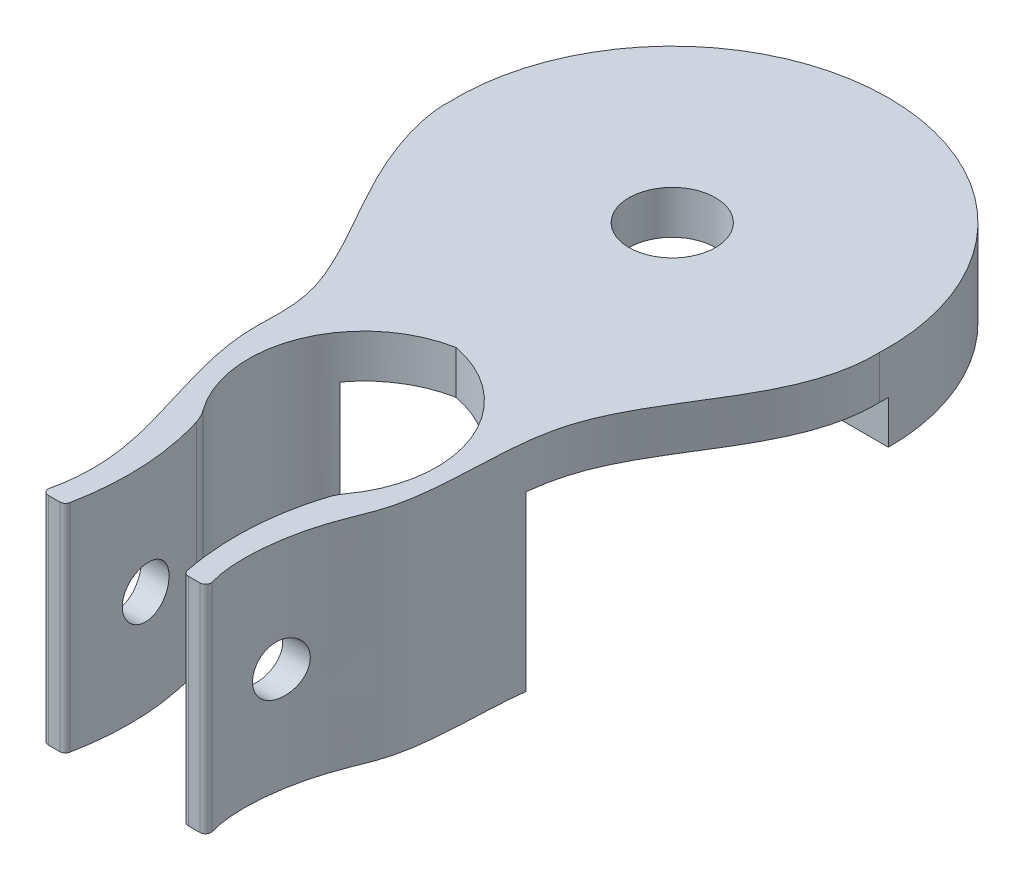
ISO-10303-21;
HEADER;
FILE_DESCRIPTION(('STEP AP214'),'2;1');
FILE_NAME('part.step','',(''),(''),'','','');
FILE_SCHEMA(('AUTOMOTIVE_DESIGN { 1 0 10303 214 1 1 1 1 }'));
ENDSEC;
DATA;
#1=APPLICATION_CONTEXT('core data for automotive mechanical design processes');
#2=APPLICATION_PROTOCOL_DEFINITION('international standard','automotive_design',2000,#1);
#3=PRODUCT_CONTEXT('',#1,'mechanical');
#4=PRODUCT('Part','Part','',(#3));
#5=PRODUCT_RELATED_PRODUCT_CATEGORY('part','',(#4));
#6=PRODUCT_DEFINITION_FORMATION('','',#4);
#7=PRODUCT_DEFINITION_CONTEXT('part definition',#1,'design');
#8=PRODUCT_DEFINITION('design','',#6,#7);
#9=PRODUCT_DEFINITION_SHAPE('','',#8);
#10=(LENGTH_UNIT() NAMED_UNIT(*) SI_UNIT(.MILLI.,.METRE.));
#11=(NAMED_UNIT(*) PLANE_ANGLE_UNIT() SI_UNIT($,.RADIAN.));
#12=(NAMED_UNIT(*) SI_UNIT($,.STERADIAN.) SOLID_ANGLE_UNIT());
#13=UNCERTAINTY_MEASURE_WITH_UNIT(LENGTH_MEASURE(1.E-05),#10,'distance_accuracy_value','');
#14=(GEOMETRIC_REPRESENTATION_CONTEXT(3) GLOBAL_UNCERTAINTY_ASSIGNED_CONTEXT((#13)) GLOBAL_UNIT_ASSIGNED_CONTEXT((#10,
#11,#12)) REPRESENTATION_CONTEXT('',''));
#15=CARTESIAN_POINT('',(0.,0.,0.));
#16=DIRECTION('',(0.,0.,1.));
#17=DIRECTION('',(1.,0.,0.));
#18=AXIS2_PLACEMENT_3D('',#15,#16,#17);
#19=CARTESIAN_POINT('',(-6.93411925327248,0.,15.7482204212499));
#20=DIRECTION('',(0.,-1.,0.));
#21=DIRECTION('',(0.,0.,-1.));
#22=AXIS2_PLACEMENT_3D('',#19,#20,#21);
#23=PLANE('',#22);
#24=CARTESIAN_POINT('',(-5.38324393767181,0.,18.2884466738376));
#25=DIRECTION('',(0.,1.,0.));
#26=DIRECTION('',(0.,0.,-1.));
#27=AXIS2_PLACEMENT_3D('',#24,#25,#26);
#28=CIRCLE('',#27,3.20029970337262);
#29=CARTESIAN_POINT('',(-4.18561514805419,0.,15.3206859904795));
#30=VERTEX_POINT('',#29);
#31=CARTESIAN_POINT('',(-6.94675623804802,0.,15.4960735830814));
#32=VERTEX_POINT('',#31);
#33=EDGE_CURVE('E231',#30,#32,#28,.T.);
#34=ORIENTED_EDGE('',*,*,#33,.F.);
#35=CARTESIAN_POINT('',(1.25597785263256,0.,19.3588384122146));
#36=DIRECTION('',(0.,-1.,0.));
#37=DIRECTION('',(0.,0.,1.));
#38=AXIS2_PLACEMENT_3D('',#35,#36,#37);
#39=CIRCLE('',#38,6.77625334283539);
#40=CARTESIAN_POINT('',(-4.21241176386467,0.,23.3606285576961));
#41=VERTEX_POINT('',#40);
#42=EDGE_CURVE('E383',#41,#30,#39,.T.);
#43=ORIENTED_EDGE('',*,*,#42,.F.);
#44=CARTESIAN_POINT('',(-6.26217420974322,0.,24.8606531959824));
#45=DIRECTION('',(0.,1.,0.));
#46=DIRECTION('',(0.,0.,-1.));
#47=AXIS2_PLACEMENT_3D('',#44,#45,#46);
#48=CIRCLE('',#47,2.54);
#49=CARTESIAN_POINT('',(-3.83488723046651,0.,24.1124032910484));
#50=VERTEX_POINT('',#49);
#51=EDGE_CURVE('E378',#50,#41,#48,.T.);
#52=ORIENTED_EDGE('',*,*,#51,.F.);
#53=CARTESIAN_POINT('',(-3.45189480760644,0.,31.932369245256));
#54=CARTESIAN_POINT('',(-3.03837590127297,0.,29.8419376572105));
#55=CARTESIAN_POINT('',(-3.0285914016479,0.,27.2020407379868));
#56=CARTESIAN_POINT('',(-3.6668448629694,0.,24.6575247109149));
#57=CARTESIAN_POINT('',(-3.83488723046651,0.,24.1124032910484));
#58=B_SPLINE_CURVE_WITH_KNOTS('',3,(#53,#54,#55,#56,#57),.UNSPECIFIED.,.F.,.F.,(4,1,4),
(0.0550755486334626,0.772138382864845,0.969570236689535),.UNSPECIFIED.);
#59=CARTESIAN_POINT('',(-3.45189480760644,0.,31.932369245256));
#60=VERTEX_POINT('',#59);
#61=EDGE_CURVE('E374',#60,#50,#58,.T.);
#62=ORIENTED_EDGE('',*,*,#61,.F.);
#63=CARTESIAN_POINT('',(-3.77597646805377,0.,31.8682610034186));
#64=DIRECTION('',(0.,1.,0.));
#65=DIRECTION('',(0.,0.,-1.));
#66=AXIS2_PLACEMENT_3D('',#63,#64,#65);
#67=CIRCLE('',#66,0.330361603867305);
#68=CARTESIAN_POINT('',(-3.77597646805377,0.,32.1986226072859));
#69=VERTEX_POINT('',#68);
#70=EDGE_CURVE('E372',#69,#60,#67,.T.);
#71=ORIENTED_EDGE('',*,*,#70,.F.);
#72=DIRECTION('',(1.,0.,0.));
#73=VECTOR('',#72,1.);
#74=CARTESIAN_POINT('',(-4.45105676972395,0.,32.1986226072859));
#75=LINE('',#74,#73);
#76=CARTESIAN_POINT('',(-4.45105676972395,0.,32.1986226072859));
#77=VERTEX_POINT('',#76);
#78=EDGE_CURVE('E370',#77,#69,#75,.T.);
#79=ORIENTED_EDGE('',*,*,#78,.F.);
#80=CARTESIAN_POINT('',(-4.45105676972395,0.,31.8682610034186));
#81=DIRECTION('',(0.,1.,0.));
#82=DIRECTION('',(0.,0.,1.));
#83=AXIS2_PLACEMENT_3D('',#80,#81,#82);
#84=CIRCLE('',#83,0.330361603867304);
#85=CARTESIAN_POINT('',(-4.77346849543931,0.,31.7962230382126));
#86=VERTEX_POINT('',#85);
#87=EDGE_CURVE('E364',#86,#77,#84,.T.);
#88=ORIENTED_EDGE('',*,*,#87,.F.);
#89=CARTESIAN_POINT('',(-12.6900757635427,0.,0.50197322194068));
#90=CARTESIAN_POINT('',(-12.7085946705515,0.,0.534595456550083));
#91=CARTESIAN_POINT('',(-12.9445111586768,0.,3.81873144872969));
#92=CARTESIAN_POINT('',(-6.44251711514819,0.,13.8864500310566));
#93=CARTESIAN_POINT('',(-7.36026092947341,0.,18.4591788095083));
#94=CARTESIAN_POINT('',(-5.27387900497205,0.,24.7590934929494));
#95=CARTESIAN_POINT('',(-4.15604476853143,0.,29.0328933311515));
#96=CARTESIAN_POINT('',(-4.77346849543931,0.,31.7962230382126));
#97=B_SPLINE_CURVE_WITH_KNOTS('',3,(#89,#90,#91,#92,#93,#94,#95,#96),.UNSPECIFIED.,.F.,.F.,(4,1,
1,1,1,4),(0.,0.279659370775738,0.433863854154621,0.566787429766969,0.759908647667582,
0.988953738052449),.UNSPECIFIED.);
#98=EDGE_CURVE('E360',#32,#86,#97,.T.);
#99=ORIENTED_EDGE('',*,*,#98,.F.);
#100=EDGE_LOOP('',(#34,#43,#52,#62,#71,#79,#88,#99));
#101=FACE_BOUND('',#100,.T.);
#102=ADVANCED_FACE('F33',(#101),#23,.T.);
#103=CARTESIAN_POINT('',(0.,10.16,0.));
#104=DIRECTION('',(0.,1.,0.));
#105=DIRECTION('',(0.,0.,1.));
#106=AXIS2_PLACEMENT_3D('',#103,#104,#105);
#107=PLANE('',#106);
#108=CARTESIAN_POINT('',(0.,10.16,0.));
#109=DIRECTION('',(0.,1.,0.));
#110=DIRECTION('',(0.,0.,1.));
#111=AXIS2_PLACEMENT_3D('',#108,#109,#110);
#112=CIRCLE('',#111,2.54);
#113=CARTESIAN_POINT('',(0.,10.16,2.54));
#114=VERTEX_POINT('',#113);
#115=EDGE_CURVE('E319',#114,#114,#112,.T.);
#116=ORIENTED_EDGE('',*,*,#115,.T.);
#117=EDGE_LOOP('',(#116));
#118=FACE_BOUND('',#117,.T.);
#119=CARTESIAN_POINT('',(0.,10.16,0.));
#120=DIRECTION('',(0.,1.,0.));
#121=DIRECTION('',(0.,0.,1.));
#122=AXIS2_PLACEMENT_3D('',#119,#120,#121);
#123=CIRCLE('',#122,12.7);
#124=CARTESIAN_POINT('',(12.6900757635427,10.16,0.501973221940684));
#125=VERTEX_POINT('',#124);
#126=CARTESIAN_POINT('',(12.7,10.16,0.));
#127=VERTEX_POINT('',#126);
#128=EDGE_CURVE('E320',#125,#127,#123,.T.);
#129=ORIENTED_EDGE('',*,*,#128,.F.);
#130=CARTESIAN_POINT('',(4.77346849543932,10.16,31.7962230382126));
#131=CARTESIAN_POINT('',(4.26261652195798,10.16,30.1479997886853));
#132=CARTESIAN_POINT('',(4.52523901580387,10.16,26.6602313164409));
#133=CARTESIAN_POINT('',(7.08560364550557,10.16,20.9954102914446));
#134=CARTESIAN_POINT('',(5.48854782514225,10.16,11.2875043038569));
#135=CARTESIAN_POINT('',(12.8342449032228,10.16,5.63803468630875));
#136=CARTESIAN_POINT('',(12.6900757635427,10.16,0.501973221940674));
#137=B_SPLINE_CURVE_WITH_KNOTS('',3,(#130,#131,#132,#133,#134,#135,#136),.UNSPECIFIED.,.F.,.F.,
(4,1,1,1,4),(0.,0.239032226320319,0.296991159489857,0.579589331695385,1.),.UNSPECIFIED.);
#138=CARTESIAN_POINT('',(6.85490923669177,10.16,15.4465952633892));
#139=VERTEX_POINT('',#138);
#140=EDGE_CURVE('E222',#139,#125,#137,.T.);
#141=ORIENTED_EDGE('',*,*,#140,.F.);
#142=CARTESIAN_POINT('',(5.38324393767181,10.16,18.2884466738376));
#143=DIRECTION('',(0.,1.,0.));
#144=DIRECTION('',(0.,0.,1.));
#145=AXIS2_PLACEMENT_3D('',#142,#143,#144);
#146=CIRCLE('',#145,3.20029970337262);
#147=CARTESIAN_POINT('',(4.18561514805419,10.16,15.3206859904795));
#148=VERTEX_POINT('',#147);
#149=EDGE_CURVE('E220',#139,#148,#146,.T.);
#150=ORIENTED_EDGE('',*,*,#149,.T.);
#151=CARTESIAN_POINT('',(-1.25597785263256,10.16,19.3588384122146));
#152=DIRECTION('',(0.,1.,0.));
#153=DIRECTION('',(0.,0.,1.));
#154=AXIS2_PLACEMENT_3D('',#151,#152,#153);
#155=CIRCLE('',#154,6.77625334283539);
#156=CARTESIAN_POINT('',(0.,10.16,12.7));
#157=VERTEX_POINT('',#156);
#158=EDGE_CURVE('E207',#157,#148,#155,.F.);
#159=ORIENTED_EDGE('',*,*,#158,.F.);
#160=CARTESIAN_POINT('',(1.25597785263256,10.16,19.3588384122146));
#161=DIRECTION('',(0.,1.,0.));
#162=DIRECTION('',(0.,0.,1.));
#163=AXIS2_PLACEMENT_3D('',#160,#161,#162);
#164=CIRCLE('',#163,6.77625334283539);
#165=CARTESIAN_POINT('',(-4.18561514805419,10.16,15.3206859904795));
#166=VERTEX_POINT('',#165);
#167=EDGE_CURVE('E216',#166,#157,#164,.F.);
#168=ORIENTED_EDGE('',*,*,#167,.F.);
#169=CARTESIAN_POINT('',(-5.38324393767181,10.16,18.2884466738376));
#170=DIRECTION('',(0.,1.,0.));
#171=DIRECTION('',(0.,0.,-1.));
#172=AXIS2_PLACEMENT_3D('',#169,#170,#171);
#173=CIRCLE('',#172,3.20029970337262);
#174=CARTESIAN_POINT('',(-6.94675623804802,10.16,15.4960735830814));
#175=VERTEX_POINT('',#174);
#176=EDGE_CURVE('E235',#166,#175,#173,.T.);
#177=ORIENTED_EDGE('',*,*,#176,.T.);
#178=CARTESIAN_POINT('',(-12.6900757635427,10.16,0.50197322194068));
#179=CARTESIAN_POINT('',(-12.7085946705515,10.16,0.534595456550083));
#180=CARTESIAN_POINT('',(-12.9445111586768,10.16,3.81873144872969));
#181=CARTESIAN_POINT('',(-6.44251711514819,10.16,13.8864500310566));
#182=CARTESIAN_POINT('',(-7.36026092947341,10.16,18.4591788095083));
#183=CARTESIAN_POINT('',(-5.27387900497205,10.16,24.7590934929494));
#184=CARTESIAN_POINT('',(-4.15604476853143,10.16,29.0328933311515));
#185=CARTESIAN_POINT('',(-4.77346849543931,10.16,31.7962230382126));
#186=B_SPLINE_CURVE_WITH_KNOTS('',3,(#178,#179,#180,#181,#182,#183,#184,#185),.UNSPECIFIED.,.F.,
.F.,(4,1,1,1,1,4),(0.,0.279659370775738,0.433863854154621,0.566787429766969,0.759908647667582,
0.988953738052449),.UNSPECIFIED.);
#187=CARTESIAN_POINT('',(-12.6900757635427,10.16,0.501973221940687));
#188=VERTEX_POINT('',#187);
#189=EDGE_CURVE('E217',#188,#175,#186,.T.);
#190=ORIENTED_EDGE('',*,*,#189,.F.);
#191=CARTESIAN_POINT('',(-12.7,10.16,0.));
#192=VERTEX_POINT('',#191);
#193=EDGE_CURVE('E450',#192,#188,#123,.T.);
#194=ORIENTED_EDGE('',*,*,#193,.F.);
#195=DIRECTION('',(1.,0.,0.));
#196=VECTOR('',#195,1.);
#197=CARTESIAN_POINT('',(0.,10.16,2.06928460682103E-13));
#198=LINE('',#197,#196);
#199=CARTESIAN_POINT('',(-8.89000000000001,10.16,0.));
#200=VERTEX_POINT('',#199);
#201=EDGE_CURVE('E267',#192,#200,#198,.T.);
#202=ORIENTED_EDGE('',*,*,#201,.T.);
#203=DIRECTION('',(0.,0.,-1.));
#204=VECTOR('',#203,1.);
#205=CARTESIAN_POINT('',(-8.89000000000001,10.16,0.));
#206=LINE('',#205,#204);
#207=CARTESIAN_POINT('',(-8.89,10.16,-9.06961410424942));
#208=VERTEX_POINT('',#207);
#209=EDGE_CURVE('E262',#200,#208,#206,.T.);
#210=ORIENTED_EDGE('',*,*,#209,.T.);
#211=CARTESIAN_POINT('',(8.89,10.16,-9.06961410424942));
#212=VERTEX_POINT('',#211);
#213=EDGE_CURVE('E453',#212,#208,#123,.T.);
#214=ORIENTED_EDGE('',*,*,#213,.F.);
#215=DIRECTION('',(0.,0.,-1.));
#216=VECTOR('',#215,1.);
#217=CARTESIAN_POINT('',(8.89000000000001,10.16,0.));
#218=LINE('',#217,#216);
#219=CARTESIAN_POINT('',(8.89000000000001,10.16,0.));
#220=VERTEX_POINT('',#219);
#221=EDGE_CURVE('E55',#220,#212,#218,.T.);
#222=ORIENTED_EDGE('',*,*,#221,.F.);
#223=DIRECTION('',(-1.,0.,0.));
#224=VECTOR('',#223,1.);
#225=CARTESIAN_POINT('',(0.,10.16,0.));
#226=LINE('',#225,#224);
#227=EDGE_CURVE('E59',#127,#220,#226,.T.);
#228=ORIENTED_EDGE('',*,*,#227,.F.);
#229=EDGE_LOOP('',(#129,#141,#150,#159,#168,#177,#190,#194,#202,#210,#214,#222,#228));
#230=FACE_BOUND('',#229,.T.);
#231=ADVANCED_FACE('F221',(#118,#230),#107,.F.);
#232=CARTESIAN_POINT('',(-12.6900757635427,12.7,0.50197322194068));
#233=CARTESIAN_POINT('',(-12.7085946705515,12.7,0.534595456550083));
#234=CARTESIAN_POINT('',(-12.9445111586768,12.7,3.81873144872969));
#235=CARTESIAN_POINT('',(-6.44251711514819,12.7,13.8864500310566));
#236=CARTESIAN_POINT('',(-7.36026092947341,12.7,18.4591788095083));
#237=CARTESIAN_POINT('',(-5.27387900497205,12.7,24.7590934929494));
#238=CARTESIAN_POINT('',(-4.15604476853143,12.7,29.0328933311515));
#239=CARTESIAN_POINT('',(-4.77346849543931,12.7,31.7962230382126));
#240=B_SPLINE_CURVE_WITH_KNOTS('',3,(#232,#233,#234,#235,#236,#237,#238,#239),.UNSPECIFIED.,.F.,
.F.,(4,1,1,1,1,4),(0.,0.279659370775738,0.433863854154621,0.566787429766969,0.759908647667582,
0.988953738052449),.UNSPECIFIED.);
#241=DIRECTION('',(0.,-1.,0.));
#242=VECTOR('',#241,1.);
#243=SURFACE_OF_LINEAR_EXTRUSION('',#240,#242);
#244=CARTESIAN_POINT('',(-4.95633280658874,6.16582696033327,26.2198274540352));
#245=CARTESIAN_POINT('',(-4.95633093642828,6.24700173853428,26.2198332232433));
#246=CARTESIAN_POINT('',(-4.95468988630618,6.32825554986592,26.2265713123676));
#247=CARTESIAN_POINT('',(-4.94984501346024,6.44829752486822,26.2465882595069));
#248=CARTESIAN_POINT('',(-4.94783030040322,6.48803576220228,26.2549227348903));
#249=CARTESIAN_POINT('',(-4.94303519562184,6.56668331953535,26.2748321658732));
#250=CARTESIAN_POINT('',(-4.94025417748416,6.60559193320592,26.2864097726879));
#251=CARTESIAN_POINT('',(-4.93082928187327,6.72045100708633,26.3258242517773));
#252=CARTESIAN_POINT('',(-4.92309473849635,6.79474723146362,26.3583785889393));
#253=CARTESIAN_POINT('',(-4.90513999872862,6.93677734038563,26.4350646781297));
#254=CARTESIAN_POINT('',(-4.89491932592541,7.00450996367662,26.4791986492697));
#255=CARTESIAN_POINT('',(-4.8780643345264,7.10031269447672,26.5534114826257));
#256=CARTESIAN_POINT('',(-4.87214051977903,7.13149723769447,26.5797179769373));
#257=CARTESIAN_POINT('',(-4.85988117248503,7.19150813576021,26.6347494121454));
#258=CARTESIAN_POINT('',(-4.85354604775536,7.22033676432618,26.6634719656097));
#259=CARTESIAN_POINT('',(-4.83403048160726,7.3030778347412,26.7530398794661));
#260=CARTESIAN_POINT('',(-4.82033748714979,7.35325866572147,26.8172957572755));
#261=CARTESIAN_POINT('',(-4.79194668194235,7.44340495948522,26.954756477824));
#262=CARTESIAN_POINT('',(-4.77723230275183,7.48308343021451,27.0281449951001));
#263=CARTESIAN_POINT('',(-4.7478441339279,7.54952543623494,27.1805759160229));
#264=CARTESIAN_POINT('',(-4.73317034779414,7.57628789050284,27.2596187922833));
#265=CARTESIAN_POINT('',(-4.70439156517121,7.61634436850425,27.4221089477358));
#266=CARTESIAN_POINT('',(-4.69029466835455,7.62948593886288,27.5055953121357));
#267=CARTESIAN_POINT('',(-4.66344952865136,7.64131172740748,27.6738028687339));
#268=CARTESIAN_POINT('',(-4.6507012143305,7.6399967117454,27.7585239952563));
#269=CARTESIAN_POINT('',(-4.62710919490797,7.62290283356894,27.9259812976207));
#270=CARTESIAN_POINT('',(-4.61624936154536,7.60725441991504,28.0087284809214));
#271=CARTESIAN_POINT('',(-4.59654475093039,7.56201088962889,28.1705694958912));
#272=CARTESIAN_POINT('',(-4.5876997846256,7.53241708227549,28.249663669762));
#273=CARTESIAN_POINT('',(-4.57219484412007,7.46064779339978,28.4005773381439));
#274=CARTESIAN_POINT('',(-4.56550202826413,7.41868223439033,28.4724933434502));
#275=CARTESIAN_POINT('',(-4.55397270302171,7.32316274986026,28.6083335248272));
#276=CARTESIAN_POINT('',(-4.54913611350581,7.26960932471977,28.6722580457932));
#277=CARTESIAN_POINT('',(-4.54107983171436,7.15291119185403,28.7897424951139));
#278=CARTESIAN_POINT('',(-4.53784746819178,7.0898469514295,28.8433815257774));
#279=CARTESIAN_POINT('',(-4.53260550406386,6.9556019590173,28.9393752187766));
#280=CARTESIAN_POINT('',(-4.53059590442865,6.88442120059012,28.9817298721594));
#281=CARTESIAN_POINT('',(-4.52746056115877,6.73592427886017,29.0539565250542));
#282=CARTESIAN_POINT('',(-4.52633526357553,6.65860504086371,29.0838222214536));
#283=CARTESIAN_POINT('',(-4.52469256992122,6.50005194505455,29.1301893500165));
#284=CARTESIAN_POINT('',(-4.52417517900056,6.41881805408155,29.1466906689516));
#285=CARTESIAN_POINT('',(-4.5235805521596,6.25457859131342,29.1658783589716));
#286=CARTESIAN_POINT('',(-4.52350414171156,6.17156998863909,29.1685388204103));
#287=CARTESIAN_POINT('',(-4.52376568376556,6.0062827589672,29.1598991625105));
#288=CARTESIAN_POINT('',(-4.52410363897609,5.92400413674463,29.1485989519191));
#289=CARTESIAN_POINT('',(-4.52531127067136,5.76247392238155,29.1123509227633));
#290=CARTESIAN_POINT('',(-4.52618119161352,5.68322373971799,29.0873968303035));
#291=CARTESIAN_POINT('',(-4.52869534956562,5.53004418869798,29.0245498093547));
#292=CARTESIAN_POINT('',(-4.53033958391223,5.45611480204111,28.9866569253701));
#293=CARTESIAN_POINT('',(-4.5347255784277,5.315737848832,28.8990565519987));
#294=CARTESIAN_POINT('',(-4.53746648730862,5.24928453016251,28.8493582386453));
#295=CARTESIAN_POINT('',(-4.54439265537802,5.12568716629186,28.7395737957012));
#296=CARTESIAN_POINT('',(-4.54857787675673,5.0685428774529,28.6794879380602));
#297=CARTESIAN_POINT('',(-4.55868346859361,4.96528612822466,28.5508211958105));
#298=CARTESIAN_POINT('',(-4.5646002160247,4.91915099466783,28.4822582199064));
#299=CARTESIAN_POINT('',(-4.57836141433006,4.83902980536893,28.3385472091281));
#300=CARTESIAN_POINT('',(-4.58620583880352,4.80504358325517,28.2633992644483));
#301=CARTESIAN_POINT('',(-4.60386021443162,4.75008054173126,28.1086349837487));
#302=CARTESIAN_POINT('',(-4.61367186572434,4.72911503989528,28.0290148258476));
#303=CARTESIAN_POINT('',(-4.63510249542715,4.70071797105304,27.8676361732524));
#304=CARTESIAN_POINT('',(-4.64672157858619,4.69328718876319,27.7858775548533));
#305=CARTESIAN_POINT('',(-4.67156280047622,4.69204470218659,27.6216286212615));
#306=CARTESIAN_POINT('',(-4.6848003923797,4.69837582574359,27.5391395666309));
#307=CARTESIAN_POINT('',(-4.71227529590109,4.72466608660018,27.3765440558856));
#308=CARTESIAN_POINT('',(-4.72651271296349,4.74462666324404,27.2964378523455));
#309=CARTESIAN_POINT('',(-4.75560874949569,4.79804313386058,27.1394370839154));
#310=CARTESIAN_POINT('',(-4.77047368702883,4.83171169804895,27.0626152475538));
#311=CARTESIAN_POINT('',(-4.79250147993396,4.89156529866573,26.9525368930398));
#312=CARTESIAN_POINT('',(-4.79980055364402,4.91308011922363,26.9166966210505));
#313=CARTESIAN_POINT('',(-4.81422874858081,4.95911590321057,26.8469095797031));
#314=CARTESIAN_POINT('',(-4.82135768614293,4.98363995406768,26.8129648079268));
#315=CARTESIAN_POINT('',(-4.84240612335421,5.06173030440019,26.714069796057));
#316=CARTESIAN_POINT('',(-4.85592141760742,5.11963802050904,26.6523839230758));
#317=CARTESIAN_POINT('',(-4.88109901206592,5.24537960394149,26.5396758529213));
#318=CARTESIAN_POINT('',(-4.89276166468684,5.31321157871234,26.4886516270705));
#319=CARTESIAN_POINT('',(-4.908284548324,5.42040035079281,26.4216479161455));
#320=CARTESIAN_POINT('',(-4.91310441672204,5.45677478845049,26.4010094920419));
#321=CARTESIAN_POINT('',(-4.92206046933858,5.53117479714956,26.3628837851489));
#322=CARTESIAN_POINT('',(-4.92619724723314,5.56919889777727,26.3453937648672));
#323=CARTESIAN_POINT('',(-4.93748410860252,5.68533852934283,26.2978861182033));
#324=CARTESIAN_POINT('',(-4.94352972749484,5.76565119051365,26.2727497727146));
#325=CARTESIAN_POINT('',(-4.95069263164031,5.89970092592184,26.2430743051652));
#326=CARTESIAN_POINT('',(-4.95280201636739,5.95251744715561,26.2343717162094));
#327=CARTESIAN_POINT('',(-4.95562270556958,6.05882018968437,26.2227464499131));
#328=CARTESIAN_POINT('',(-4.95633403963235,6.11230639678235,26.2198236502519));
#329=CARTESIAN_POINT('',(-4.95633280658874,6.16582696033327,26.2198274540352));
#330=B_SPLINE_CURVE_WITH_KNOTS('',3,(#244,#245,#246,#247,#248,#249,#250,#251,#252,#253,#254,
#255,#256,#257,#258,#259,#260,#261,#262,#263,#264,#265,#266,#267,#268,#269,#270,#271,#272,#273,
#274,#275,#276,#277,#278,#279,#280,#281,#282,#283,#284,#285,#286,#287,#288,#289,#290,#291,#292,
#293,#294,#295,#296,#297,#298,#299,#300,#301,#302,#303,#304,#305,#306,#307,#308,#309,#310,#311,
#312,#313,#314,#315,#316,#317,#318,#319,#320,#321,#322,#323,#324,#325,#326,#327,#328,#329),
.UNSPECIFIED.,.T.,.F.,(4,2,2,2,2,2,2,2,2,2,2,2,2,2,2,2,2,2,2,2,2,2,2,2,2,2,2,2,2,2,2,2,2,2,2,2,
2,2,2,2,2,2,4),(0.,0.24329340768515,0.365133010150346,0.487072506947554,0.730312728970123,
0.973599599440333,1.09715425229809,1.2205882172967,1.46740609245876,1.7203991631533,
1.97341340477,2.22922992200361,2.48503288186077,2.73853065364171,2.99200463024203,
3.24140354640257,3.49079169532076,3.73817734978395,3.98556320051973,4.23307375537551,
4.48058640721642,4.72856222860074,4.97653967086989,5.22463115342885,5.47272178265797,
5.72062020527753,5.96851213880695,6.21588904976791,6.46326257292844,6.71085081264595,
6.95845340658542,7.20863800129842,7.4588490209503,7.71309952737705,7.84027490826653,
7.96758187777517,8.22330883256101,8.47898708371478,8.60514352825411,8.73118974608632,
8.98282541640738,9.14323824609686,9.30364768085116),.UNSPECIFIED.);
#331=CARTESIAN_POINT('',(-4.95633280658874,6.16582696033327,26.2198274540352));
#332=VERTEX_POINT('',#331);
#333=EDGE_CURVE('E39',#332,#332,#330,.T.);
#334=ORIENTED_EDGE('',*,*,#333,.T.);
#335=EDGE_LOOP('',(#334));
#336=FACE_BOUND('',#335,.T.);
#337=ORIENTED_EDGE('',*,*,#189,.T.);
#338=DIRECTION('',(0.,-1.,0.));
#339=VECTOR('',#338,1.);
#340=CARTESIAN_POINT('',(-6.94675623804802,10.16,15.4960735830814));
#341=LINE('',#340,#339);
#342=EDGE_CURVE('E240',#175,#32,#341,.T.);
#343=ORIENTED_EDGE('',*,*,#342,.T.);
#344=ORIENTED_EDGE('',*,*,#98,.T.);
#345=DIRECTION('',(0.,-1.,0.));
#346=VECTOR('',#345,1.);
#347=CARTESIAN_POINT('',(-4.77346849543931,12.7,31.7962230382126));
#348=LINE('',#347,#346);
#349=CARTESIAN_POINT('',(-4.77346849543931,12.7,31.7962230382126));
#350=VERTEX_POINT('',#349);
#351=EDGE_CURVE('E11',#350,#86,#348,.T.);
#352=ORIENTED_EDGE('',*,*,#351,.F.);
#353=CARTESIAN_POINT('',(-12.6900757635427,12.7,0.501973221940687));
#354=VERTEX_POINT('',#353);
#355=EDGE_CURVE('E408',#354,#350,#240,.T.);
#356=ORIENTED_EDGE('',*,*,#355,.F.);
#357=DIRECTION('',(0.,-1.,0.));
#358=VECTOR('',#357,1.);
#359=CARTESIAN_POINT('',(-12.6900757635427,12.7,0.501973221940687));
#360=LINE('',#359,#358);
#361=EDGE_CURVE('E359',#354,#188,#360,.T.);
#362=ORIENTED_EDGE('',*,*,#361,.T.);
#363=EDGE_LOOP('',(#337,#343,#344,#352,#356,#362));
#364=FACE_BOUND('',#363,.T.);
#365=ADVANCED_FACE('F35',(#336,#364),#243,.F.);
#366=CARTESIAN_POINT('',(1.25597785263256,12.7,19.3588384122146));
#367=DIRECTION('',(0.,-1.,0.));
#368=DIRECTION('',(0.,0.,-1.));
#369=AXIS2_PLACEMENT_3D('',#366,#367,#368);
#370=CYLINDRICAL_SURFACE('',#369,6.77625334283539);
#371=ORIENTED_EDGE('',*,*,#42,.T.);
#372=DIRECTION('',(0.,-1.,0.));
#373=VECTOR('',#372,1.);
#374=CARTESIAN_POINT('',(-4.18561514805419,10.16,15.3206859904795));
#375=LINE('',#374,#373);
#376=EDGE_CURVE('E238',#166,#30,#375,.T.);
#377=ORIENTED_EDGE('',*,*,#376,.F.);
#378=ORIENTED_EDGE('',*,*,#167,.T.);
#379=DIRECTION('',(0.,-1.,0.));
#380=VECTOR('',#379,1.);
#381=CARTESIAN_POINT('',(0.,12.7,12.7));
#382=LINE('',#381,#380);
#383=CARTESIAN_POINT('',(0.,12.7,12.7));
#384=VERTEX_POINT('',#383);
#385=EDGE_CURVE('E215',#384,#157,#382,.T.);
#386=ORIENTED_EDGE('',*,*,#385,.F.);
#387=CARTESIAN_POINT('',(1.25597785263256,12.7,19.3588384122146));
#388=DIRECTION('',(0.,-1.,0.));
#389=DIRECTION('',(0.,0.,1.));
#390=AXIS2_PLACEMENT_3D('',#387,#388,#389);
#391=CIRCLE('',#390,6.77625334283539);
#392=CARTESIAN_POINT('',(-4.21241176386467,12.7,23.3606285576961));
#393=VERTEX_POINT('',#392);
#394=EDGE_CURVE('E566',#393,#384,#391,.T.);
#395=ORIENTED_EDGE('',*,*,#394,.F.);
#396=DIRECTION('',(0.,-1.,0.));
#397=VECTOR('',#396,1.);
#398=CARTESIAN_POINT('',(-4.21241176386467,12.7,23.3606285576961));
#399=LINE('',#398,#397);
#400=EDGE_CURVE('E436',#393,#41,#399,.T.);
#401=ORIENTED_EDGE('',*,*,#400,.T.);
#402=EDGE_LOOP('',(#371,#377,#378,#386,#395,#401));
#403=FACE_BOUND('',#402,.T.);
#404=ADVANCED_FACE('F576',(#403),#370,.F.);
#405=CARTESIAN_POINT('',(-1.25597785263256,12.7,19.3588384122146));
#406=DIRECTION('',(0.,-1.,0.));
#407=DIRECTION('',(0.,0.,-1.));
#408=AXIS2_PLACEMENT_3D('',#405,#406,#407);
#409=CYLINDRICAL_SURFACE('',#408,6.77625334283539);
#410=ORIENTED_EDGE('',*,*,#158,.T.);
#411=DIRECTION('',(0.,-1.,0.));
#412=VECTOR('',#411,1.);
#413=CARTESIAN_POINT('',(4.18561514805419,10.16,15.3206859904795));
#414=LINE('',#413,#412);
#415=CARTESIAN_POINT('',(4.18561514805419,0.,15.3206859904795));
#416=VERTEX_POINT('',#415);
#417=EDGE_CURVE('E211',#148,#416,#414,.T.);
#418=ORIENTED_EDGE('',*,*,#417,.T.);
#419=CARTESIAN_POINT('',(-1.25597785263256,0.,19.3588384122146));
#420=DIRECTION('',(0.,-1.,0.));
#421=DIRECTION('',(0.,0.,-1.));
#422=AXIS2_PLACEMENT_3D('',#419,#420,#421);
#423=CIRCLE('',#422,6.77625334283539);
#424=CARTESIAN_POINT('',(4.21241176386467,0.,23.3606285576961));
#425=VERTEX_POINT('',#424);
#426=EDGE_CURVE('E386',#416,#425,#423,.T.);
#427=ORIENTED_EDGE('',*,*,#426,.T.);
#428=DIRECTION('',(0.,-1.,0.));
#429=VECTOR('',#428,1.);
#430=CARTESIAN_POINT('',(4.21241176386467,12.7,23.3606285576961));
#431=LINE('',#430,#429);
#432=CARTESIAN_POINT('',(4.21241176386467,12.7,23.3606285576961));
#433=VERTEX_POINT('',#432);
#434=EDGE_CURVE('E432',#433,#425,#431,.T.);
#435=ORIENTED_EDGE('',*,*,#434,.F.);
#436=CARTESIAN_POINT('',(-1.25597785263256,12.7,19.3588384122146));
#437=DIRECTION('',(0.,-1.,0.));
#438=DIRECTION('',(0.,0.,-1.));
#439=AXIS2_PLACEMENT_3D('',#436,#437,#438);
#440=CIRCLE('',#439,6.77625334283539);
#441=EDGE_CURVE('E565',#384,#433,#440,.T.);
#442=ORIENTED_EDGE('',*,*,#441,.F.);
#443=ORIENTED_EDGE('',*,*,#385,.T.);
#444=EDGE_LOOP('',(#410,#418,#427,#435,#442,#443));
#445=FACE_BOUND('',#444,.T.);
#446=ADVANCED_FACE('F209',(#445),#409,.F.);
#447=CARTESIAN_POINT('',(4.77346849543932,12.7,31.7962230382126));
#448=CARTESIAN_POINT('',(4.26261652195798,12.7,30.1479997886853));
#449=CARTESIAN_POINT('',(4.52523901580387,12.7,26.6602313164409));
#450=CARTESIAN_POINT('',(7.08560364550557,12.7,20.9954102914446));
#451=CARTESIAN_POINT('',(5.48854782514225,12.7,11.2875043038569));
#452=CARTESIAN_POINT('',(12.8342449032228,12.7,5.63803468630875));
#453=CARTESIAN_POINT('',(12.6900757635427,12.7,0.501973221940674));
#454=B_SPLINE_CURVE_WITH_KNOTS('',3,(#447,#448,#449,#450,#451,#452,#453),.UNSPECIFIED.,.F.,.F.,
(4,1,1,1,4),(0.,0.239032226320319,0.296991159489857,0.579589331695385,1.),.UNSPECIFIED.);
#455=DIRECTION('',(0.,-1.,0.));
#456=VECTOR('',#455,1.);
#457=SURFACE_OF_LINEAR_EXTRUSION('',#454,#456);
#458=CARTESIAN_POINT('',(4.95845871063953,6.16582696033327,26.2198274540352));
#459=CARTESIAN_POINT('',(4.95845648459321,6.08479950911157,26.2198332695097));
#460=CARTESIAN_POINT('',(4.95671313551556,6.00369267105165,26.2265473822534));
#461=CARTESIAN_POINT('',(4.9515812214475,5.88387338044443,26.2464895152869));
#462=CARTESIAN_POINT('',(4.94944838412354,5.84420943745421,26.2547926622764));
#463=CARTESIAN_POINT('',(4.94438042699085,5.76571085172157,26.274625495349));
#464=CARTESIAN_POINT('',(4.94144465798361,5.72687690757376,26.2861577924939));
#465=CARTESIAN_POINT('',(4.93151565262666,5.61225019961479,26.3254107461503));
#466=CARTESIAN_POINT('',(4.92339080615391,5.53810931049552,26.3578250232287));
#467=CARTESIAN_POINT('',(4.90463187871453,5.39635927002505,26.4341701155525));
#468=CARTESIAN_POINT('',(4.89399726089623,5.32875152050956,26.478103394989));
#469=CARTESIAN_POINT('',(4.87654497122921,5.23301634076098,26.5520403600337));
#470=CARTESIAN_POINT('',(4.87041646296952,5.20180090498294,26.5782942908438));
#471=CARTESIAN_POINT('',(4.85776718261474,5.14172291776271,26.6332234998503));
#472=CARTESIAN_POINT('',(4.85124680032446,5.11285809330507,26.6618963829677));
#473=CARTESIAN_POINT('',(4.83121393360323,5.02999863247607,26.7513227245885));
#474=CARTESIAN_POINT('',(4.81722734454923,4.97972615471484,26.8154938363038));
#475=CARTESIAN_POINT('',(4.78834285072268,4.88930263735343,26.952922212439));
#476=CARTESIAN_POINT('',(4.77343060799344,4.84945588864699,27.0263755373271));
#477=CARTESIAN_POINT('',(4.74375116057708,4.78270859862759,27.1789889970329));
#478=CARTESIAN_POINT('',(4.72898396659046,4.75580900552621,27.2581495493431));
#479=CARTESIAN_POINT('',(4.70008899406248,4.71555381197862,27.4207926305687));
#480=CARTESIAN_POINT('',(4.68596872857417,4.70233092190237,27.5043093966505));
#481=CARTESIAN_POINT('',(4.65905230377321,4.69035619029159,27.6725875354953));
#482=CARTESIAN_POINT('',(4.64625607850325,4.6916036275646,27.7573488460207));
#483=CARTESIAN_POINT('',(4.62248192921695,4.7085721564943,27.9248639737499));
#484=CARTESIAN_POINT('',(4.61148826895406,4.7241591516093,28.0076291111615));
#485=CARTESIAN_POINT('',(4.59139006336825,4.76927992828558,28.1695070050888));
#486=CARTESIAN_POINT('',(4.58228535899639,4.79881253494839,28.2486200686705));
#487=CARTESIAN_POINT('',(4.56613190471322,4.87050792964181,28.3996769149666));
#488=CARTESIAN_POINT('',(4.55905473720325,4.91247744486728,28.4717094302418));
#489=CARTESIAN_POINT('',(4.5466782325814,5.00803989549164,28.6077719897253));
#490=CARTESIAN_POINT('',(4.54137881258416,5.06163228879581,28.6718024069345));
#491=CARTESIAN_POINT('',(4.53238140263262,5.17843369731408,28.7894713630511));
#492=CARTESIAN_POINT('',(4.52867064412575,5.24156030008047,28.8431907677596));
#493=CARTESIAN_POINT('',(4.52251523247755,5.37595870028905,28.9393228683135));
#494=CARTESIAN_POINT('',(4.52007057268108,5.44723045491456,28.9817356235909));
#495=CARTESIAN_POINT('',(4.51616716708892,5.59583696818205,29.0540018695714));
#496=CARTESIAN_POINT('',(4.51470768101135,5.67316712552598,29.0838647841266));
#497=CARTESIAN_POINT('',(4.51253618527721,5.83174552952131,29.1302233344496));
#498=CARTESIAN_POINT('',(4.51182418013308,5.9129937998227,29.1467188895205));
#499=CARTESIAN_POINT('',(4.51100322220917,6.07721570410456,29.1658849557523));
#500=CARTESIAN_POINT('',(4.51089505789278,6.16019145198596,29.1685373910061));
#501=CARTESIAN_POINT('',(4.51125973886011,6.32541215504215,29.1598928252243));
#502=CARTESIAN_POINT('',(4.51173258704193,6.40765710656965,29.1485957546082));
#503=CARTESIAN_POINT('',(4.51336065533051,6.56911727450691,29.1123665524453));
#504=CARTESIAN_POINT('',(4.51451616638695,6.64833118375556,29.0874286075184));
#505=CARTESIAN_POINT('',(4.51771634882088,6.80143947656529,29.024628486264));
#506=CARTESIAN_POINT('',(4.5197610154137,6.87533388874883,28.9867663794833));
#507=CARTESIAN_POINT('',(4.52500919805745,7.01565075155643,28.8992406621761));
#508=CARTESIAN_POINT('',(4.52821190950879,7.0820783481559,28.8495852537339));
#509=CARTESIAN_POINT('',(4.53605912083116,7.20563248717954,28.7399020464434));
#510=CARTESIAN_POINT('',(4.54070359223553,7.26275921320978,28.679874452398));
#511=CARTESIAN_POINT('',(4.55166591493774,7.36603739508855,28.5512843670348));
#512=CARTESIAN_POINT('',(4.55798161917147,7.41220278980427,28.4827328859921));
#513=CARTESIAN_POINT('',(4.57243330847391,7.49238589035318,28.3390377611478));
#514=CARTESIAN_POINT('',(4.58056928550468,7.52640364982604,28.2638941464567));
#515=CARTESIAN_POINT('',(4.59869529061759,7.58146295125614,28.1090326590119));
#516=CARTESIAN_POINT('',(4.60868909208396,7.60247770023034,28.0293057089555));
#517=CARTESIAN_POINT('',(4.63038584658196,7.63093564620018,27.8676945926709));
#518=CARTESIAN_POINT('',(4.6420888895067,7.63837812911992,27.7858103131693));
#519=CARTESIAN_POINT('',(4.66704632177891,7.63960045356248,27.6213301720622));
#520=CARTESIAN_POINT('',(4.68031518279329,7.63324157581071,27.5387354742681));
#521=CARTESIAN_POINT('',(4.70786966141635,7.60686158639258,27.375942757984));
#522=CARTESIAN_POINT('',(4.72215537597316,7.58683917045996,27.2957449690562));
#523=CARTESIAN_POINT('',(4.75141223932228,7.53330734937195,27.1386885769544));
#524=CARTESIAN_POINT('',(4.76639043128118,7.49960134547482,27.0618975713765));
#525=CARTESIAN_POINT('',(4.78868177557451,7.43970713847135,26.9518814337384));
#526=CARTESIAN_POINT('',(4.79608437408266,7.41818125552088,26.9160644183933));
#527=CARTESIAN_POINT('',(4.81075215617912,7.37212952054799,26.8463281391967));
#528=CARTESIAN_POINT('',(4.81801718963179,7.34760058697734,26.8124108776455));
#529=CARTESIAN_POINT('',(4.83953521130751,7.26946507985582,26.7135508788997));
#530=CARTESIAN_POINT('',(4.85343253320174,7.21151855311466,26.651883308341));
#531=CARTESIAN_POINT('',(4.87945954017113,7.08570544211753,26.5392212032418));
#532=CARTESIAN_POINT('',(4.89158956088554,7.01784074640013,26.4882246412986));
#533=CARTESIAN_POINT('',(4.90781529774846,6.91055265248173,26.4212353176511));
#534=CARTESIAN_POINT('',(4.91287075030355,6.87411281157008,26.400587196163));
#535=CARTESIAN_POINT('',(4.92228305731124,6.79957448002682,26.3624504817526));
#536=CARTESIAN_POINT('',(4.92664051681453,6.76147746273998,26.3449591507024));
#537=CARTESIAN_POINT('',(4.93854689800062,6.64510981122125,26.2974634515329));
#538=CARTESIAN_POINT('',(4.94495028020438,6.564629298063,26.2723541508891));
#539=CARTESIAN_POINT('',(4.95251426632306,6.43065506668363,26.2428465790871));
#540=CARTESIAN_POINT('',(4.95473647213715,6.37809510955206,26.2342294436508));
#541=CARTESIAN_POINT('',(4.95770940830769,6.27231051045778,26.2227180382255));
#542=CARTESIAN_POINT('',(4.95846017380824,6.21908588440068,26.219823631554));
#543=CARTESIAN_POINT('',(4.95845871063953,6.16582696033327,26.2198274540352));
#544=B_SPLINE_CURVE_WITH_KNOTS('',3,(#458,#459,#460,#461,#462,#463,#464,#465,#466,#467,#468,
#469,#470,#471,#472,#473,#474,#475,#476,#477,#478,#479,#480,#481,#482,#483,#484,#485,#486,#487,
#488,#489,#490,#491,#492,#493,#494,#495,#496,#497,#498,#499,#500,#501,#502,#503,#504,#505,#506,
#507,#508,#509,#510,#511,#512,#513,#514,#515,#516,#517,#518,#519,#520,#521,#522,#523,#524,#525,
#526,#527,#528,#529,#530,#531,#532,#533,#534,#535,#536,#537,#538,#539,#540,#541,#542,#543),
.UNSPECIFIED.,.T.,.F.,(4,2,2,2,2,2,2,2,2,2,2,2,2,2,2,2,2,2,2,2,2,2,2,2,2,2,2,2,2,2,2,2,2,2,2,2,
2,2,2,2,2,2,4),(0.,0.242851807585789,0.364472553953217,0.486191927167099,0.728959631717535,
0.971779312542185,1.0953935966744,1.2188868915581,1.46582477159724,1.71932135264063,
1.97283649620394,2.22878915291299,2.48472905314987,2.73829959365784,2.99184877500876,
3.24164773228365,3.49143504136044,3.73917522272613,3.98691410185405,4.23446661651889,
4.48202062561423,4.72989780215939,4.97777621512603,5.22576034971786,5.47374314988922,
5.72155398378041,5.96935992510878,6.21684903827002,6.46433705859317,6.71233334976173,
6.96034268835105,7.21085633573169,7.46139389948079,7.71566617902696,7.84285360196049,
7.97017264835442,8.22612433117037,8.48202734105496,8.60844947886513,8.73476142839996,
8.98691611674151,9.14654516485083,9.30617040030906),.UNSPECIFIED.);
#545=CARTESIAN_POINT('',(4.95845871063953,6.16582696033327,26.2198274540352));
#546=VERTEX_POINT('',#545);
#547=EDGE_CURVE('E284',#546,#546,#544,.T.);
#548=ORIENTED_EDGE('',*,*,#547,.T.);
#549=EDGE_LOOP('',(#548));
#550=FACE_BOUND('',#549,.T.);
#551=CARTESIAN_POINT('',(4.77346849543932,0.,31.7962230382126));
#552=CARTESIAN_POINT('',(4.26261652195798,0.,30.1479997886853));
#553=CARTESIAN_POINT('',(4.52523901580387,0.,26.6602313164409));
#554=CARTESIAN_POINT('',(7.08560364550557,0.,20.9954102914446));
#555=CARTESIAN_POINT('',(5.48854782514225,0.,11.2875043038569));
#556=CARTESIAN_POINT('',(12.8342449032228,0.,5.63803468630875));
#557=CARTESIAN_POINT('',(12.6900757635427,0.,0.501973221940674));
#558=B_SPLINE_CURVE_WITH_KNOTS('',3,(#551,#552,#553,#554,#555,#556,#557),.UNSPECIFIED.,.F.,.F.,
(4,1,1,1,4),(0.,0.239032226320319,0.296991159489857,0.579589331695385,1.),.UNSPECIFIED.);
#559=CARTESIAN_POINT('',(4.77346849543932,0.,31.7962230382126));
#560=VERTEX_POINT('',#559);
#561=CARTESIAN_POINT('',(6.85490923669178,0.,15.4465952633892));
#562=VERTEX_POINT('',#561);
#563=EDGE_CURVE('E403',#560,#562,#558,.T.);
#564=ORIENTED_EDGE('',*,*,#563,.T.);
#565=DIRECTION('',(0.,-1.,0.));
#566=VECTOR('',#565,1.);
#567=CARTESIAN_POINT('',(6.85490923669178,12.7,15.4465952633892));
#568=LINE('',#567,#566);
#569=EDGE_CURVE('E229',#562,#139,#568,.F.);
#570=ORIENTED_EDGE('',*,*,#569,.T.);
#571=ORIENTED_EDGE('',*,*,#140,.T.);
#572=DIRECTION('',(0.,-1.,0.));
#573=VECTOR('',#572,1.);
#574=CARTESIAN_POINT('',(12.6900757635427,12.7,0.501973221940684));
#575=LINE('',#574,#573);
#576=CARTESIAN_POINT('',(12.6900757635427,12.7,0.501973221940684));
#577=VERTEX_POINT('',#576);
#578=EDGE_CURVE('E414',#577,#125,#575,.T.);
#579=ORIENTED_EDGE('',*,*,#578,.F.);
#580=CARTESIAN_POINT('',(4.77346849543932,12.7,31.7962230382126));
#581=VERTEX_POINT('',#580);
#582=EDGE_CURVE('E349',#581,#577,#454,.T.);
#583=ORIENTED_EDGE('',*,*,#582,.F.);
#584=DIRECTION('',(0.,-1.,0.));
#585=VECTOR('',#584,1.);
#586=CARTESIAN_POINT('',(4.77346849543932,12.7,31.7962230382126));
#587=LINE('',#586,#585);
#588=EDGE_CURVE('E417',#581,#560,#587,.T.);
#589=ORIENTED_EDGE('',*,*,#588,.T.);
#590=EDGE_LOOP('',(#564,#570,#571,#579,#583,#589));
#591=FACE_BOUND('',#590,.T.);
#592=ADVANCED_FACE('F295',(#550,#591),#457,.F.);
#593=CARTESIAN_POINT('',(-6.93411925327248,12.7,15.7482204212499));
#594=DIRECTION('',(0.,-1.,0.));
#595=DIRECTION('',(0.,0.,-1.));
#596=AXIS2_PLACEMENT_3D('',#593,#594,#595);
#597=PLANE('',#596);
#598=ORIENTED_EDGE('',*,*,#355,.T.);
#599=CARTESIAN_POINT('',(-4.45105676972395,12.7,31.8682610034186));
#600=DIRECTION('',(0.,1.,0.));
#601=DIRECTION('',(0.,0.,1.));
#602=AXIS2_PLACEMENT_3D('',#599,#600,#601);
#603=CIRCLE('',#602,0.330361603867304);
#604=CARTESIAN_POINT('',(-4.45105676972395,12.7,32.1986226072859));
#605=VERTEX_POINT('',#604);
#606=EDGE_CURVE('E480',#350,#605,#603,.T.);
#607=ORIENTED_EDGE('',*,*,#606,.T.);
#608=DIRECTION('',(1.,0.,0.));
#609=VECTOR('',#608,1.);
#610=CARTESIAN_POINT('',(-4.45105676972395,12.7,32.1986226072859));
#611=LINE('',#610,#609);
#612=CARTESIAN_POINT('',(-3.77597646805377,12.7,32.1986226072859));
#613=VERTEX_POINT('',#612);
#614=EDGE_CURVE('E485',#605,#613,#611,.T.);
#615=ORIENTED_EDGE('',*,*,#614,.T.);
#616=CARTESIAN_POINT('',(-3.77597646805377,12.7,31.8682610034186));
#617=DIRECTION('',(0.,1.,0.));
#618=DIRECTION('',(0.,0.,-1.));
#619=AXIS2_PLACEMENT_3D('',#616,#617,#618);
#620=CIRCLE('',#619,0.330361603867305);
#621=CARTESIAN_POINT('',(-3.45189480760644,12.7,31.932369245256));
#622=VERTEX_POINT('',#621);
#623=EDGE_CURVE('E487',#613,#622,#620,.T.);
#624=ORIENTED_EDGE('',*,*,#623,.T.);
#625=CARTESIAN_POINT('',(-3.45189480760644,12.7,31.932369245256));
#626=CARTESIAN_POINT('',(-3.03837590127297,12.7,29.8419376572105));
#627=CARTESIAN_POINT('',(-3.0285914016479,12.7,27.2020407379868));
#628=CARTESIAN_POINT('',(-3.6668448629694,12.7,24.6575247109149));
#629=CARTESIAN_POINT('',(-3.83488723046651,12.7,24.1124032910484));
#630=B_SPLINE_CURVE_WITH_KNOTS('',3,(#625,#626,#627,#628,#629),.UNSPECIFIED.,.F.,.F.,(4,1,4),
(0.0550755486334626,0.772138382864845,0.969570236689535),.UNSPECIFIED.);
#631=CARTESIAN_POINT('',(-3.83488723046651,12.7,24.1124032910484));
#632=VERTEX_POINT('',#631);
#633=EDGE_CURVE('E489',#622,#632,#630,.T.);
#634=ORIENTED_EDGE('',*,*,#633,.T.);
#635=CARTESIAN_POINT('',(-6.26217420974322,12.7,24.8606531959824));
#636=DIRECTION('',(0.,1.,0.));
#637=DIRECTION('',(0.,0.,-1.));
#638=AXIS2_PLACEMENT_3D('',#635,#636,#637);
#639=CIRCLE('',#638,2.54);
#640=EDGE_CURVE('E494',#632,#393,#639,.T.);
#641=ORIENTED_EDGE('',*,*,#640,.T.);
#642=ORIENTED_EDGE('',*,*,#394,.T.);
#643=ORIENTED_EDGE('',*,*,#441,.T.);
#644=CARTESIAN_POINT('',(6.26217420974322,12.7,24.8606531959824));
#645=DIRECTION('',(0.,1.,0.));
#646=DIRECTION('',(0.,0.,1.));
#647=AXIS2_PLACEMENT_3D('',#644,#645,#646);
#648=CIRCLE('',#647,2.54);
#649=CARTESIAN_POINT('',(3.83488723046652,12.7,24.1124032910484));
#650=VERTEX_POINT('',#649);
#651=EDGE_CURVE('E340',#433,#650,#648,.T.);
#652=ORIENTED_EDGE('',*,*,#651,.T.);
#653=CARTESIAN_POINT('',(3.83488723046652,12.7,24.1124032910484));
#654=CARTESIAN_POINT('',(3.66684486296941,12.7,24.6575247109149));
#655=CARTESIAN_POINT('',(3.02859140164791,12.7,27.2020407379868));
#656=CARTESIAN_POINT('',(3.03837590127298,12.7,29.8419376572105));
#657=CARTESIAN_POINT('',(3.45189480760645,12.7,31.932369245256));
#658=B_SPLINE_CURVE_WITH_KNOTS('',3,(#653,#654,#655,#656,#657),.UNSPECIFIED.,.F.,.F.,(4,1,4),
(0.0550755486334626,0.252507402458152,0.969570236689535),.UNSPECIFIED.);
#659=CARTESIAN_POINT('',(3.45189480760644,12.7,31.932369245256));
#660=VERTEX_POINT('',#659);
#661=EDGE_CURVE('E333',#650,#660,#658,.T.);
#662=ORIENTED_EDGE('',*,*,#661,.T.);
#663=CARTESIAN_POINT('',(3.77597646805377,12.7,31.8682610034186));
#664=DIRECTION('',(0.,1.,0.));
#665=DIRECTION('',(0.,0.,1.));
#666=AXIS2_PLACEMENT_3D('',#663,#664,#665);
#667=CIRCLE('',#666,0.330361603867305);
#668=CARTESIAN_POINT('',(3.77597646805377,12.7,32.1986226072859));
#669=VERTEX_POINT('',#668);
#670=EDGE_CURVE('E339',#660,#669,#667,.T.);
#671=ORIENTED_EDGE('',*,*,#670,.T.);
#672=DIRECTION('',(1.,0.,0.));
#673=VECTOR('',#672,1.);
#674=CARTESIAN_POINT('',(4.45105676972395,12.7,32.1986226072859));
#675=LINE('',#674,#673);
#676=CARTESIAN_POINT('',(4.45105676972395,12.7,32.1986226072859));
#677=VERTEX_POINT('',#676);
#678=EDGE_CURVE('E346',#669,#677,#675,.T.);
#679=ORIENTED_EDGE('',*,*,#678,.T.);
#680=CARTESIAN_POINT('',(4.45105676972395,12.7,31.8682610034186));
#681=DIRECTION('',(0.,1.,0.));
#682=DIRECTION('',(0.,0.,-1.));
#683=AXIS2_PLACEMENT_3D('',#680,#681,#682);
#684=CIRCLE('',#683,0.330361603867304);
#685=EDGE_CURVE('E348',#677,#581,#684,.T.);
#686=ORIENTED_EDGE('',*,*,#685,.T.);
#687=ORIENTED_EDGE('',*,*,#582,.T.);
#688=CARTESIAN_POINT('',(0.,12.7,0.));
#689=DIRECTION('',(0.,1.,0.));
#690=DIRECTION('',(0.,0.,-1.));
#691=AXIS2_PLACEMENT_3D('',#688,#689,#690);
#692=CIRCLE('',#691,12.7);
#693=EDGE_CURVE('E354',#577,#354,#692,.T.);
#694=ORIENTED_EDGE('',*,*,#693,.T.);
#695=EDGE_LOOP('',(#598,#607,#615,#624,#634,#641,#642,#643,#652,#662,#671,#679,#686,#687,#694));
#696=FACE_BOUND('',#695,.T.);
#697=CARTESIAN_POINT('',(0.,12.7,0.));
#698=DIRECTION('',(0.,1.,0.));
#699=DIRECTION('',(0.,0.,1.));
#700=AXIS2_PLACEMENT_3D('',#697,#698,#699);
#701=CIRCLE('',#700,2.54);
#702=CARTESIAN_POINT('',(0.,12.7,2.54));
#703=VERTEX_POINT('',#702);
#704=EDGE_CURVE('E365',#703,#703,#701,.T.);
#705=ORIENTED_EDGE('',*,*,#704,.F.);
#706=EDGE_LOOP('',(#705));
#707=FACE_BOUND('',#706,.T.);
#708=ADVANCED_FACE('F522',(#696,#707),#597,.F.);
#709=CARTESIAN_POINT('',(5.38324393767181,0.,18.2884466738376));
#710=DIRECTION('',(0.,1.,0.));
#711=DIRECTION('',(0.,0.,1.));
#712=AXIS2_PLACEMENT_3D('',#709,#710,#711);
#713=CIRCLE('',#712,3.20029970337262);
#714=EDGE_CURVE('E225',#562,#416,#713,.T.);
#715=ORIENTED_EDGE('',*,*,#714,.F.);
#716=ORIENTED_EDGE('',*,*,#563,.F.);
#717=CARTESIAN_POINT('',(4.45105676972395,0.,31.8682610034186));
#718=DIRECTION('',(0.,1.,0.));
#719=DIRECTION('',(0.,0.,-1.));
#720=AXIS2_PLACEMENT_3D('',#717,#718,#719);
#721=CIRCLE('',#720,0.330361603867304);
#722=CARTESIAN_POINT('',(4.45105676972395,0.,32.1986226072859));
#723=VERTEX_POINT('',#722);
#724=EDGE_CURVE('E401',#723,#560,#721,.T.);
#725=ORIENTED_EDGE('',*,*,#724,.F.);
#726=DIRECTION('',(1.,0.,0.));
#727=VECTOR('',#726,1.);
#728=CARTESIAN_POINT('',(4.45105676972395,0.,32.1986226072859));
#729=LINE('',#728,#727);
#730=CARTESIAN_POINT('',(3.77597646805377,0.,32.1986226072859));
#731=VERTEX_POINT('',#730);
#732=EDGE_CURVE('E399',#731,#723,#729,.T.);
#733=ORIENTED_EDGE('',*,*,#732,.F.);
#734=CARTESIAN_POINT('',(3.77597646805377,0.,31.8682610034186));
#735=DIRECTION('',(0.,1.,0.));
#736=DIRECTION('',(0.,0.,1.));
#737=AXIS2_PLACEMENT_3D('',#734,#735,#736);
#738=CIRCLE('',#737,0.330361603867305);
#739=CARTESIAN_POINT('',(3.45189480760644,0.,31.932369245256));
#740=VERTEX_POINT('',#739);
#741=EDGE_CURVE('E394',#740,#731,#738,.T.);
#742=ORIENTED_EDGE('',*,*,#741,.F.);
#743=CARTESIAN_POINT('',(3.83488723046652,0.,24.1124032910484));
#744=CARTESIAN_POINT('',(3.66684486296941,0.,24.6575247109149));
#745=CARTESIAN_POINT('',(3.02859140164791,0.,27.2020407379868));
#746=CARTESIAN_POINT('',(3.03837590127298,0.,29.8419376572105));
#747=CARTESIAN_POINT('',(3.45189480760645,0.,31.932369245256));
#748=B_SPLINE_CURVE_WITH_KNOTS('',3,(#743,#744,#745,#746,#747),.UNSPECIFIED.,.F.,.F.,(4,1,4),
(0.0550755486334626,0.252507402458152,0.969570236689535),.UNSPECIFIED.);
#749=CARTESIAN_POINT('',(3.83488723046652,0.,24.1124032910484));
#750=VERTEX_POINT('',#749);
#751=EDGE_CURVE('E390',#750,#740,#748,.T.);
#752=ORIENTED_EDGE('',*,*,#751,.F.);
#753=CARTESIAN_POINT('',(6.26217420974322,0.,24.8606531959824));
#754=DIRECTION('',(0.,1.,0.));
#755=DIRECTION('',(0.,0.,1.));
#756=AXIS2_PLACEMENT_3D('',#753,#754,#755);
#757=CIRCLE('',#756,2.54);
#758=EDGE_CURVE('E388',#425,#750,#757,.T.);
#759=ORIENTED_EDGE('',*,*,#758,.F.);
#760=ORIENTED_EDGE('',*,*,#426,.F.);
#761=EDGE_LOOP('',(#715,#716,#725,#733,#742,#752,#759,#760));
#762=FACE_BOUND('',#761,.T.);
#763=ADVANCED_FACE('F516',(#762),#23,.T.);
#764=CARTESIAN_POINT('',(-4.45105676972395,12.7,31.8682610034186));
#765=DIRECTION('',(0.,-1.,0.));
#766=DIRECTION('',(0.,0.,-1.));
#767=AXIS2_PLACEMENT_3D('',#764,#765,#766);
#768=CYLINDRICAL_SURFACE('',#767,0.330361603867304);
#769=ORIENTED_EDGE('',*,*,#87,.T.);
#770=DIRECTION('',(0.,-1.,0.));
#771=VECTOR('',#770,1.);
#772=CARTESIAN_POINT('',(-4.45105676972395,12.7,32.1986226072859));
#773=LINE('',#772,#771);
#774=EDGE_CURVE('E47',#605,#77,#773,.T.);
#775=ORIENTED_EDGE('',*,*,#774,.F.);
#776=ORIENTED_EDGE('',*,*,#606,.F.);
#777=ORIENTED_EDGE('',*,*,#351,.T.);
#778=EDGE_LOOP('',(#769,#775,#776,#777));
#779=FACE_BOUND('',#778,.T.);
#780=ADVANCED_FACE('F513',(#779),#768,.T.);
#781=CARTESIAN_POINT('',(-4.45105676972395,12.7,32.1986226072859));
#782=DIRECTION('',(0.,0.,-1.));
#783=DIRECTION('',(-1.,0.,0.));
#784=AXIS2_PLACEMENT_3D('',#781,#782,#783);
#785=PLANE('',#784);
#786=ORIENTED_EDGE('',*,*,#78,.T.);
#787=DIRECTION('',(0.,-1.,0.));
#788=VECTOR('',#787,1.);
#789=CARTESIAN_POINT('',(-3.77597646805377,12.7,32.1986226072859));
#790=LINE('',#789,#788);
#791=EDGE_CURVE('E445',#613,#69,#790,.T.);
#792=ORIENTED_EDGE('',*,*,#791,.F.);
#793=ORIENTED_EDGE('',*,*,#614,.F.);
#794=ORIENTED_EDGE('',*,*,#774,.T.);
#795=EDGE_LOOP('',(#786,#792,#793,#794));
#796=FACE_BOUND('',#795,.T.);
#797=ADVANCED_FACE('F510',(#796),#785,.F.);
#798=CARTESIAN_POINT('',(-3.77597646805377,12.7,31.8682610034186));
#799=DIRECTION('',(0.,-1.,0.));
#800=DIRECTION('',(0.,0.,-1.));
#801=AXIS2_PLACEMENT_3D('',#798,#799,#800);
#802=CYLINDRICAL_SURFACE('',#801,0.330361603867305);
#803=ORIENTED_EDGE('',*,*,#70,.T.);
#804=DIRECTION('',(0.,-1.,0.));
#805=VECTOR('',#804,1.);
#806=CARTESIAN_POINT('',(-3.45189480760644,12.7,31.932369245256));
#807=LINE('',#806,#805);
#808=EDGE_CURVE('E442',#622,#60,#807,.T.);
#809=ORIENTED_EDGE('',*,*,#808,.F.);
#810=ORIENTED_EDGE('',*,*,#623,.F.);
#811=ORIENTED_EDGE('',*,*,#791,.T.);
#812=EDGE_LOOP('',(#803,#809,#810,#811));
#813=FACE_BOUND('',#812,.T.);
#814=ADVANCED_FACE('F505',(#813),#802,.T.);
#815=DIRECTION('',(0.,-1.,0.));
#816=VECTOR('',#815,1.);
#817=SURFACE_OF_LINEAR_EXTRUSION('',#630,#816);
#818=CARTESIAN_POINT('',(-3.33934247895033,6.16582696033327,26.2198274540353));
#819=CARTESIAN_POINT('',(-3.33934086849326,6.08373832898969,26.2198331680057));
#820=CARTESIAN_POINT('',(-3.33821005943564,6.00156900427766,26.226722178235));
#821=CARTESIAN_POINT('',(-3.33489129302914,5.88016079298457,26.2472026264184));
#822=CARTESIAN_POINT('',(-3.33351287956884,5.83996798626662,26.2557313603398));
#823=CARTESIAN_POINT('',(-3.33024358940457,5.76041519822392,26.2761133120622));
#824=CARTESIAN_POINT('',(-3.32835227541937,5.72105595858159,26.2879693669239));
#825=CARTESIAN_POINT('',(-3.32196873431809,5.60483588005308,26.3283600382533));
#826=CARTESIAN_POINT('',(-3.31676155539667,5.52964543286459,26.3617490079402));
#827=CARTESIAN_POINT('',(-3.30483871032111,5.3859491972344,26.4405007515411));
#828=CARTESIAN_POINT('',(-3.29812289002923,5.31744409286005,26.4858647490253));
#829=CARTESIAN_POINT('',(-3.287270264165,5.22087860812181,26.562056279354));
#830=CARTESIAN_POINT('',(-3.28350487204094,5.1896002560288,26.588945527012));
#831=CARTESIAN_POINT('',(-3.27579029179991,5.12944594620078,26.6452071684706));
#832=CARTESIAN_POINT('',(-3.27184128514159,5.10056769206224,26.6745771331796));
#833=CARTESIAN_POINT('',(-3.25981332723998,5.01777101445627,26.7661781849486));
#834=CARTESIAN_POINT('',(-3.25155115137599,4.96767081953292,26.8319161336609));
#835=CARTESIAN_POINT('',(-3.23502516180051,4.87874108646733,26.9714682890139));
#836=CARTESIAN_POINT('',(-3.22676208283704,4.8400235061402,27.0453534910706));
#837=CARTESIAN_POINT('',(-3.21081925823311,4.77556656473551,27.1986549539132));
#838=CARTESIAN_POINT('',(-3.203139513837,4.74982723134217,27.2780712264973));
#839=CARTESIAN_POINT('',(-3.18877972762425,4.71210242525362,27.4401846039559));
#840=CARTESIAN_POINT('',(-3.18209958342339,4.70011554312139,27.522881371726));
#841=CARTESIAN_POINT('',(-3.17002334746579,4.6902788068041,27.6892048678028));
#842=CARTESIAN_POINT('',(-3.16462720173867,4.69242835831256,27.7728315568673));
#843=CARTESIAN_POINT('',(-3.15528621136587,4.71078433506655,27.9380390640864));
#844=CARTESIAN_POINT('',(-3.15133186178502,4.72689624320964,28.0196298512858));
#845=CARTESIAN_POINT('',(-3.14480750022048,4.7726199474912,28.1789943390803));
#846=CARTESIAN_POINT('',(-3.14223745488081,4.80223141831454,28.2567681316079));
#847=CARTESIAN_POINT('',(-3.13833932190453,4.87395943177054,28.4059186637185));
#848=CARTESIAN_POINT('',(-3.13700571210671,4.91601925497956,28.4773225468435));
#849=CARTESIAN_POINT('',(-3.13530828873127,5.01150373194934,28.612090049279));
#850=CARTESIAN_POINT('',(-3.13494447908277,5.06492843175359,28.6754536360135));
#851=CARTESIAN_POINT('',(-3.13487197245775,5.18167132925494,28.7923846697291));
#852=CARTESIAN_POINT('',(-3.13516373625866,5.24499645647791,28.8459451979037));
#853=CARTESIAN_POINT('',(-3.13607098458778,5.3797220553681,28.9417017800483));
#854=CARTESIAN_POINT('',(-3.13668647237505,5.45112260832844,28.9838977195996));
#855=CARTESIAN_POINT('',(-3.1379383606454,5.6001306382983,29.055805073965));
#856=CARTESIAN_POINT('',(-3.13857480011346,5.67775012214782,29.085491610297));
#857=CARTESIAN_POINT('',(-3.13963032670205,5.83687180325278,29.1314168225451));
#858=CARTESIAN_POINT('',(-3.14004941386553,5.91837399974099,29.1476555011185));
#859=CARTESIAN_POINT('',(-3.14053278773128,6.08296906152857,29.1662258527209));
#860=CARTESIAN_POINT('',(-3.14059698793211,6.16606230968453,29.1685541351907));
#861=CARTESIAN_POINT('',(-3.14035017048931,6.33145979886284,29.1592282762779));
#862=CARTESIAN_POINT('',(-3.14003915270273,6.41376403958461,29.1475741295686));
#863=CARTESIAN_POINT('',(-3.13914188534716,6.57522581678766,29.1106197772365));
#864=CARTESIAN_POINT('',(-3.13855570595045,6.65438414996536,29.0853230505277));
#865=CARTESIAN_POINT('',(-3.13731499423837,6.80733247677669,29.0218035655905));
#866=CARTESIAN_POINT('',(-3.13666046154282,6.88112244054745,28.9835807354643));
#867=CARTESIAN_POINT('',(-3.13556998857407,7.02126691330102,28.8952764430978));
#868=CARTESIAN_POINT('',(-3.13513412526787,7.08761879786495,28.8451908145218));
#869=CARTESIAN_POINT('',(-3.13481150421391,7.21097254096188,28.7345892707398));
#870=CARTESIAN_POINT('',(-3.13492474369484,7.26797444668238,28.6740734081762));
#871=CARTESIAN_POINT('',(-3.1360282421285,7.37096806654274,28.5443821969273));
#872=CARTESIAN_POINT('',(-3.1370178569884,7.41696783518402,28.4752132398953));
#873=CARTESIAN_POINT('',(-3.14015240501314,7.49670273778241,28.3301594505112));
#874=CARTESIAN_POINT('',(-3.14229731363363,7.53043813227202,28.2542747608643));
#875=CARTESIAN_POINT('',(-3.14792398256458,7.5846368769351,28.0981341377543));
#876=CARTESIAN_POINT('',(-3.15140288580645,7.60512834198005,28.0178878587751));
#877=CARTESIAN_POINT('',(-3.15975948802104,7.63239895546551,27.8551710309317));
#878=CARTESIAN_POINT('',(-3.16463718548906,7.6391781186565,27.7727004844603));
#879=CARTESIAN_POINT('',(-3.17571244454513,7.6388706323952,27.6078350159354));
#880=CARTESIAN_POINT('',(-3.18191061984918,7.63177752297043,27.5254401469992));
#881=CARTESIAN_POINT('',(-3.19539584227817,7.60396631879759,27.3630861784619));
#882=CARTESIAN_POINT('',(-3.20268293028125,7.58324771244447,27.2831271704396));
#883=CARTESIAN_POINT('',(-3.21803565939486,7.52861295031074,27.1273645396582));
#884=CARTESIAN_POINT('',(-3.22610554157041,7.49462149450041,27.0515874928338));
#885=CARTESIAN_POINT('',(-3.23839852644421,7.43454320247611,26.9430989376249));
#886=CARTESIAN_POINT('',(-3.24252839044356,7.41299671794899,26.9077923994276));
#887=CARTESIAN_POINT('',(-3.2507915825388,7.3669929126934,26.8390781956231));
#888=CARTESIAN_POINT('',(-3.25492491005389,7.34253275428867,26.8056724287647));
#889=CARTESIAN_POINT('',(-3.26726433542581,7.26477932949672,26.7083811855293));
#890=CARTESIAN_POINT('',(-3.27537121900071,7.20729865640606,26.6477564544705));
#891=CARTESIAN_POINT('',(-3.29073148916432,7.08286080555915,26.5370422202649));
#892=CARTESIAN_POINT('',(-3.2979849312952,7.01590424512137,26.4869520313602));
#893=CARTESIAN_POINT('',(-3.30780939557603,6.90989490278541,26.4208569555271));
#894=CARTESIAN_POINT('',(-3.31090748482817,6.87364125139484,26.4003368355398));
#895=CARTESIAN_POINT('',(-3.31669493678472,6.79953934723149,26.3624416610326));
#896=CARTESIAN_POINT('',(-3.31938465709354,6.76169252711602,26.3450638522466));
#897=CARTESIAN_POINT('',(-3.32675631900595,6.64615805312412,26.2978579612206));
#898=CARTESIAN_POINT('',(-3.33075209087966,6.56635657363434,26.2728828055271));
#899=CARTESIAN_POINT('',(-3.3355347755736,6.43270723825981,26.2432064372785));
#900=CARTESIAN_POINT('',(-3.3369576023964,6.37973092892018,26.2344531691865));
#901=CARTESIAN_POINT('',(-3.33886197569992,6.27312355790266,26.2227618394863));
#902=CARTESIAN_POINT('',(-3.3393435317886,6.21949250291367,26.2198237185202));
#903=CARTESIAN_POINT('',(-3.33934247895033,6.16582696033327,26.2198274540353));
#904=B_SPLINE_CURVE_WITH_KNOTS('',3,(#818,#819,#820,#821,#822,#823,#824,#825,#826,#827,#828,
#829,#830,#831,#832,#833,#834,#835,#836,#837,#838,#839,#840,#841,#842,#843,#844,#845,#846,#847,
#848,#849,#850,#851,#852,#853,#854,#855,#856,#857,#858,#859,#860,#861,#862,#863,#864,#865,#866,
#867,#868,#869,#870,#871,#872,#873,#874,#875,#876,#877,#878,#879,#880,#881,#882,#883,#884,#885,
#886,#887,#888,#889,#890,#891,#892,#893,#894,#895,#896,#897,#898,#899,#900,#901,#902,#903),
.UNSPECIFIED.,.T.,.F.,(4,2,2,2,2,2,2,2,2,2,2,2,2,2,2,2,2,2,2,2,2,2,2,2,2,2,2,2,2,2,2,2,2,2,2,2,
2,2,2,2,2,2,4),(0.,0.246035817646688,0.369248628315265,0.492566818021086,0.738640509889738,
0.984739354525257,1.10886933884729,1.23287915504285,1.48082348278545,1.73113068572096,
1.98143842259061,2.23172050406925,2.48199206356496,2.73058254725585,2.97916704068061,
3.22663588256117,3.47410572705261,3.72174956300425,3.9693958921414,4.21753243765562,
4.4656689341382,4.71386590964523,4.96206297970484,5.21019678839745,5.45833197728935,
5.70655444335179,5.95477565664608,6.20281459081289,6.45084825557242,6.69835363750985,
6.94585875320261,7.19347915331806,7.44110885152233,7.69016431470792,7.81474172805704,
7.93944147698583,8.18998013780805,8.44050248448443,8.56568748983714,8.69076223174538,
8.94049225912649,9.10134011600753,9.26218633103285),.UNSPECIFIED.);
#905=CARTESIAN_POINT('',(-3.33934247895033,6.16582696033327,26.2198274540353));
#906=VERTEX_POINT('',#905);
#907=EDGE_CURVE('E290',#906,#906,#904,.T.);
#908=ORIENTED_EDGE('',*,*,#907,.T.);
#909=EDGE_LOOP('',(#908));
#910=FACE_BOUND('',#909,.T.);
#911=ORIENTED_EDGE('',*,*,#61,.T.);
#912=DIRECTION('',(0.,-1.,0.));
#913=VECTOR('',#912,1.);
#914=CARTESIAN_POINT('',(-3.83488723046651,12.7,24.1124032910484));
#915=LINE('',#914,#913);
#916=EDGE_CURVE('E439',#632,#50,#915,.T.);
#917=ORIENTED_EDGE('',*,*,#916,.F.);
#918=ORIENTED_EDGE('',*,*,#633,.F.);
#919=ORIENTED_EDGE('',*,*,#808,.T.);
#920=EDGE_LOOP('',(#911,#917,#918,#919));
#921=FACE_BOUND('',#920,.T.);
#922=ADVANCED_FACE('F499',(#910,#921),#817,.F.);
#923=CARTESIAN_POINT('',(-6.26217420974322,12.7,24.8606531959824));
#924=DIRECTION('',(0.,-1.,0.));
#925=DIRECTION('',(0.,0.,-1.));
#926=AXIS2_PLACEMENT_3D('',#923,#924,#925);
#927=CYLINDRICAL_SURFACE('',#926,2.54);
#928=ORIENTED_EDGE('',*,*,#51,.T.);
#929=ORIENTED_EDGE('',*,*,#400,.F.);
#930=ORIENTED_EDGE('',*,*,#640,.F.);
#931=ORIENTED_EDGE('',*,*,#916,.T.);
#932=EDGE_LOOP('',(#928,#929,#930,#931));
#933=FACE_BOUND('',#932,.T.);
#934=ADVANCED_FACE('F504',(#933),#927,.T.);
#935=CARTESIAN_POINT('',(6.26217420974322,12.7,24.8606531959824));
#936=DIRECTION('',(0.,-1.,0.));
#937=DIRECTION('',(0.,0.,-1.));
#938=AXIS2_PLACEMENT_3D('',#935,#936,#937);
#939=CYLINDRICAL_SURFACE('',#938,2.54);
#940=ORIENTED_EDGE('',*,*,#758,.T.);
#941=DIRECTION('',(0.,-1.,0.));
#942=VECTOR('',#941,1.);
#943=CARTESIAN_POINT('',(3.83488723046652,12.7,24.1124032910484));
#944=LINE('',#943,#942);
#945=EDGE_CURVE('E429',#650,#750,#944,.T.);
#946=ORIENTED_EDGE('',*,*,#945,.F.);
#947=ORIENTED_EDGE('',*,*,#651,.F.);
#948=ORIENTED_EDGE('',*,*,#434,.T.);
#949=EDGE_LOOP('',(#940,#946,#947,#948));
#950=FACE_BOUND('',#949,.T.);
#951=ADVANCED_FACE('F329',(#950),#939,.T.);
#952=DIRECTION('',(0.,-1.,0.));
#953=VECTOR('',#952,1.);
#954=SURFACE_OF_LINEAR_EXTRUSION('',#658,#953);
#955=CARTESIAN_POINT('',(3.3393424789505,6.16582696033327,26.2198274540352));
#956=CARTESIAN_POINT('',(3.33934086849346,6.24791559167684,26.2198331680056));
#957=CARTESIAN_POINT('',(3.33821005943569,6.33008491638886,26.226722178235));
#958=CARTESIAN_POINT('',(3.33489129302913,6.45149312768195,26.2472026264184));
#959=CARTESIAN_POINT('',(3.33351287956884,6.49168593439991,26.2557313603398));
#960=CARTESIAN_POINT('',(3.33024358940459,6.57123872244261,26.2761133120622));
#961=CARTESIAN_POINT('',(3.32835227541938,6.61059796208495,26.2879693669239));
#962=CARTESIAN_POINT('',(3.3219687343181,6.72681804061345,26.3283600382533));
#963=CARTESIAN_POINT('',(3.31676155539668,6.80200848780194,26.3617490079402));
#964=CARTESIAN_POINT('',(3.30483871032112,6.94570472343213,26.4405007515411));
#965=CARTESIAN_POINT('',(3.29812289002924,7.01420982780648,26.4858647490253));
#966=CARTESIAN_POINT('',(3.28727026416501,7.11077531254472,26.562056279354));
#967=CARTESIAN_POINT('',(3.28350487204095,7.14205366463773,26.588945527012));
#968=CARTESIAN_POINT('',(3.27579029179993,7.20220797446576,26.6452071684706));
#969=CARTESIAN_POINT('',(3.2718412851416,7.2310862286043,26.6745771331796));
#970=CARTESIAN_POINT('',(3.25981332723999,7.31388290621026,26.7661781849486));
#971=CARTESIAN_POINT('',(3.251551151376,7.36398310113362,26.8319161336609));
#972=CARTESIAN_POINT('',(3.23502516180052,7.4529128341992,26.971468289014));
#973=CARTESIAN_POINT('',(3.22676208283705,7.49163041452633,27.0453534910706));
#974=CARTESIAN_POINT('',(3.21081925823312,7.55608735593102,27.1986549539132));
#975=CARTESIAN_POINT('',(3.20313951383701,7.58182668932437,27.2780712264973));
#976=CARTESIAN_POINT('',(3.18877972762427,7.61955149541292,27.4401846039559));
#977=CARTESIAN_POINT('',(3.1820995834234,7.63153837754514,27.522881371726));
#978=CARTESIAN_POINT('',(3.1700233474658,7.64137511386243,27.6892048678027));
#979=CARTESIAN_POINT('',(3.16462720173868,7.63922556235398,27.7728315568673));
#980=CARTESIAN_POINT('',(3.15528621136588,7.62086958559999,27.9380390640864));
#981=CARTESIAN_POINT('',(3.15133186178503,7.6047576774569,28.0196298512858));
#982=CARTESIAN_POINT('',(3.14480750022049,7.55903397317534,28.1789943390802));
#983=CARTESIAN_POINT('',(3.14223745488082,7.529422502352,28.2567681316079));
#984=CARTESIAN_POINT('',(3.13833932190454,7.457694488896,28.4059186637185));
#985=CARTESIAN_POINT('',(3.13700571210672,7.41563466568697,28.4773225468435));
#986=CARTESIAN_POINT('',(3.13530828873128,7.3201501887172,28.612090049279));
#987=CARTESIAN_POINT('',(3.13494447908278,7.26672548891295,28.6754536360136));
#988=CARTESIAN_POINT('',(3.13487197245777,7.1499825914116,28.7923846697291));
#989=CARTESIAN_POINT('',(3.13516373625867,7.08665746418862,28.8459451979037));
#990=CARTESIAN_POINT('',(3.13607098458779,6.95193186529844,28.9417017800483));
#991=CARTESIAN_POINT('',(3.13668647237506,6.8805313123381,28.9838977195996));
#992=CARTESIAN_POINT('',(3.13793836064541,6.73152328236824,29.0558050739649));
#993=CARTESIAN_POINT('',(3.13857480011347,6.65390379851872,29.085491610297));
#994=CARTESIAN_POINT('',(3.13963032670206,6.49478211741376,29.1314168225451));
#995=CARTESIAN_POINT('',(3.14004941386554,6.41327992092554,29.1476555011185));
#996=CARTESIAN_POINT('',(3.14053278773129,6.24868485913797,29.1662258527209));
#997=CARTESIAN_POINT('',(3.14059698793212,6.16559161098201,29.1685541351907));
#998=CARTESIAN_POINT('',(3.14035017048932,6.00019412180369,29.1592282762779));
#999=CARTESIAN_POINT('',(3.14003915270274,5.91788988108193,29.1475741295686));
#1000=CARTESIAN_POINT('',(3.13914188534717,5.75642810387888,29.1106197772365));
#1001=CARTESIAN_POINT('',(3.13855570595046,5.67726977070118,29.0853230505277));
#1002=CARTESIAN_POINT('',(3.13731499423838,5.52432144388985,29.0218035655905));
#1003=CARTESIAN_POINT('',(3.13666046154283,5.45053148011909,28.9835807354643));
#1004=CARTESIAN_POINT('',(3.13556998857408,5.31038700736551,28.8952764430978));
#1005=CARTESIAN_POINT('',(3.13513412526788,5.24403512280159,28.8451908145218));
#1006=CARTESIAN_POINT('',(3.13481150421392,5.12068137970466,28.7345892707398));
#1007=CARTESIAN_POINT('',(3.13492474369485,5.06367947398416,28.6740734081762));
#1008=CARTESIAN_POINT('',(3.13602824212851,4.9606858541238,28.5443821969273));
#1009=CARTESIAN_POINT('',(3.13701785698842,4.91468608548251,28.4752132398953));
#1010=CARTESIAN_POINT('',(3.14015240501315,4.83495118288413,28.3301594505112));
#1011=CARTESIAN_POINT('',(3.14229731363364,4.80121578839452,28.2542747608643));
#1012=CARTESIAN_POINT('',(3.14792398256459,4.74701704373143,28.0981341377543));
#1013=CARTESIAN_POINT('',(3.15140288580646,4.72652557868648,28.0178878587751));
#1014=CARTESIAN_POINT('',(3.15975948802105,4.69925496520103,27.8551710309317));
#1015=CARTESIAN_POINT('',(3.16463718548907,4.69247580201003,27.7727004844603));
#1016=CARTESIAN_POINT('',(3.17571244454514,4.69278328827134,27.6078350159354));
#1017=CARTESIAN_POINT('',(3.18191061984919,4.6998763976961,27.5254401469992));
#1018=CARTESIAN_POINT('',(3.19539584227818,4.72768760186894,27.3630861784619));
#1019=CARTESIAN_POINT('',(3.20268293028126,4.74840620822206,27.2831271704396));
#1020=CARTESIAN_POINT('',(3.21803565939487,4.80304097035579,27.1273645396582));
#1021=CARTESIAN_POINT('',(3.22610554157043,4.83703242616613,27.0515874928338));
#1022=CARTESIAN_POINT('',(3.23839852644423,4.89711071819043,26.9430989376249));
#1023=CARTESIAN_POINT('',(3.24252839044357,4.91865720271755,26.9077923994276));
#1024=CARTESIAN_POINT('',(3.25079158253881,4.96466100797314,26.8390781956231));
#1025=CARTESIAN_POINT('',(3.2549249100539,4.98912116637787,26.8056724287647));
#1026=CARTESIAN_POINT('',(3.26726433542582,5.06687459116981,26.7083811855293));
#1027=CARTESIAN_POINT('',(3.27537121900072,5.12435526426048,26.6477564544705));
#1028=CARTESIAN_POINT('',(3.29073148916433,5.24879311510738,26.5370422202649));
#1029=CARTESIAN_POINT('',(3.29798493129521,5.31574967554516,26.4869520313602));
#1030=CARTESIAN_POINT('',(3.30780939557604,5.42175901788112,26.4208569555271));
#1031=CARTESIAN_POINT('',(3.31090748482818,5.45801266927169,26.4003368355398));
#1032=CARTESIAN_POINT('',(3.31669493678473,5.53211457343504,26.3624416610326));
#1033=CARTESIAN_POINT('',(3.31938465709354,5.56996139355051,26.3450638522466));
#1034=CARTESIAN_POINT('',(3.32675631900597,5.68549586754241,26.2978579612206));
#1035=CARTESIAN_POINT('',(3.33075209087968,5.76529734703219,26.2728828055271));
#1036=CARTESIAN_POINT('',(3.3355347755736,5.89894668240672,26.2432064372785));
#1037=CARTESIAN_POINT('',(3.33695760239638,5.95192299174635,26.2344531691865));
#1038=CARTESIAN_POINT('',(3.33886197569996,6.05853036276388,26.2227618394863));
#1039=CARTESIAN_POINT('',(3.33934353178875,6.11216141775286,26.2198237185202));
#1040=CARTESIAN_POINT('',(3.3393424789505,6.16582696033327,26.2198274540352));
#1041=B_SPLINE_CURVE_WITH_KNOTS('',3,(#955,#956,#957,#958,#959,#960,#961,#962,#963,#964,#965,
#966,#967,#968,#969,#970,#971,#972,#973,#974,#975,#976,#977,#978,#979,#980,#981,#982,#983,#984,
#985,#986,#987,#988,#989,#990,#991,#992,#993,#994,#995,#996,#997,#998,#999,#1000,#1001,#1002,
#1003,#1004,#1005,#1006,#1007,#1008,#1009,#1010,#1011,#1012,#1013,#1014,#1015,#1016,#1017,#1018,
#1019,#1020,#1021,#1022,#1023,#1024,#1025,#1026,#1027,#1028,#1029,#1030,#1031,#1032,#1033,#1034,
#1035,#1036,#1037,#1038,#1039,#1040),.UNSPECIFIED.,.T.,.F.,(4,2,2,2,2,2,2,2,2,2,2,2,2,2,2,2,2,2,
2,2,2,2,2,2,2,2,2,2,2,2,2,2,2,2,2,2,2,2,2,2,2,2,4),(0.,0.246035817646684,0.369248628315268,
0.492566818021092,0.73864050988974,0.984739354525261,1.10886933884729,1.23287915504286,
1.48082348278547,1.73113068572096,1.9814384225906,2.23172050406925,2.48199206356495,
2.73058254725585,2.97916704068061,3.22663588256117,3.47410572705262,3.72174956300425,
3.9693958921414,4.21753243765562,4.46566893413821,4.71386590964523,4.96206297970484,
5.21019678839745,5.45833197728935,5.70655444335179,5.95477565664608,6.2028145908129,
6.45084825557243,6.69835363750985,6.94585875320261,7.19347915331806,7.44110885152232,
7.69016431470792,7.81474172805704,7.93944147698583,8.18998013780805,8.44050248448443,
8.56568748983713,8.69076223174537,8.94049225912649,9.10134011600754,9.26218633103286),.UNSPECIFIED.);
#1042=CARTESIAN_POINT('',(3.3393424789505,6.16582696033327,26.2198274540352));
#1043=VERTEX_POINT('',#1042);
#1044=EDGE_CURVE('E313',#1043,#1043,#1041,.T.);
#1045=ORIENTED_EDGE('',*,*,#1044,.T.);
#1046=EDGE_LOOP('',(#1045));
#1047=FACE_BOUND('',#1046,.T.);
#1048=ORIENTED_EDGE('',*,*,#751,.T.);
#1049=DIRECTION('',(0.,-1.,0.));
#1050=VECTOR('',#1049,1.);
#1051=CARTESIAN_POINT('',(3.45189480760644,12.7,31.932369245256));
#1052=LINE('',#1051,#1050);
#1053=EDGE_CURVE('E426',#660,#740,#1052,.T.);
#1054=ORIENTED_EDGE('',*,*,#1053,.F.);
#1055=ORIENTED_EDGE('',*,*,#661,.F.);
#1056=ORIENTED_EDGE('',*,*,#945,.T.);
#1057=EDGE_LOOP('',(#1048,#1054,#1055,#1056));
#1058=FACE_BOUND('',#1057,.T.);
#1059=ADVANCED_FACE('F322',(#1047,#1058),#954,.F.);
#1060=CARTESIAN_POINT('',(3.77597646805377,12.7,31.8682610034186));
#1061=DIRECTION('',(0.,-1.,0.));
#1062=DIRECTION('',(0.,0.,-1.));
#1063=AXIS2_PLACEMENT_3D('',#1060,#1061,#1062);
#1064=CYLINDRICAL_SURFACE('',#1063,0.330361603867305);
#1065=ORIENTED_EDGE('',*,*,#741,.T.);
#1066=DIRECTION('',(0.,-1.,0.));
#1067=VECTOR('',#1066,1.);
#1068=CARTESIAN_POINT('',(3.77597646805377,12.7,32.1986226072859));
#1069=LINE('',#1068,#1067);
#1070=EDGE_CURVE('E423',#669,#731,#1069,.T.);
#1071=ORIENTED_EDGE('',*,*,#1070,.F.);
#1072=ORIENTED_EDGE('',*,*,#670,.F.);
#1073=ORIENTED_EDGE('',*,*,#1053,.T.);
#1074=EDGE_LOOP('',(#1065,#1071,#1072,#1073));
#1075=FACE_BOUND('',#1074,.T.);
#1076=ADVANCED_FACE('F328',(#1075),#1064,.T.);
#1077=CARTESIAN_POINT('',(4.45105676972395,12.7,32.1986226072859));
#1078=DIRECTION('',(0.,0.,-1.));
#1079=DIRECTION('',(-1.,0.,0.));
#1080=AXIS2_PLACEMENT_3D('',#1077,#1078,#1079);
#1081=PLANE('',#1080);
#1082=ORIENTED_EDGE('',*,*,#732,.T.);
#1083=DIRECTION('',(0.,-1.,0.));
#1084=VECTOR('',#1083,1.);
#1085=CARTESIAN_POINT('',(4.45105676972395,12.7,32.1986226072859));
#1086=LINE('',#1085,#1084);
#1087=EDGE_CURVE('E420',#677,#723,#1086,.T.);
#1088=ORIENTED_EDGE('',*,*,#1087,.F.);
#1089=ORIENTED_EDGE('',*,*,#678,.F.);
#1090=ORIENTED_EDGE('',*,*,#1070,.T.);
#1091=EDGE_LOOP('',(#1082,#1088,#1089,#1090));
#1092=FACE_BOUND('',#1091,.T.);
#1093=ADVANCED_FACE('F544',(#1092),#1081,.F.);
#1094=CARTESIAN_POINT('',(4.45105676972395,12.7,31.8682610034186));
#1095=DIRECTION('',(0.,-1.,0.));
#1096=DIRECTION('',(0.,0.,-1.));
#1097=AXIS2_PLACEMENT_3D('',#1094,#1095,#1096);
#1098=CYLINDRICAL_SURFACE('',#1097,0.330361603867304);
#1099=ORIENTED_EDGE('',*,*,#724,.T.);
#1100=ORIENTED_EDGE('',*,*,#588,.F.);
#1101=ORIENTED_EDGE('',*,*,#685,.F.);
#1102=ORIENTED_EDGE('',*,*,#1087,.T.);
#1103=EDGE_LOOP('',(#1099,#1100,#1101,#1102));
#1104=FACE_BOUND('',#1103,.T.);
#1105=ADVANCED_FACE('F537',(#1104),#1098,.T.);
#1106=CARTESIAN_POINT('',(0.,12.7,0.));
#1107=DIRECTION('',(0.,-1.,0.));
#1108=DIRECTION('',(0.,0.,-1.));
#1109=AXIS2_PLACEMENT_3D('',#1106,#1107,#1108);
#1110=CYLINDRICAL_SURFACE('',#1109,12.7);
#1111=ORIENTED_EDGE('',*,*,#578,.T.);
#1112=ORIENTED_EDGE('',*,*,#128,.T.);
#1113=DIRECTION('',(0.,1.,0.));
#1114=VECTOR('',#1113,1.);
#1115=CARTESIAN_POINT('',(12.7,7.62,0.));
#1116=LINE('',#1115,#1114);
#1117=CARTESIAN_POINT('',(12.7,7.62,0.));
#1118=VERTEX_POINT('',#1117);
#1119=EDGE_CURVE('E259',#1118,#127,#1116,.T.);
#1120=ORIENTED_EDGE('',*,*,#1119,.F.);
#1121=CARTESIAN_POINT('',(0.,7.62,0.));
#1122=DIRECTION('',(0.,-1.,0.));
#1123=DIRECTION('',(0.,0.,-1.));
#1124=AXIS2_PLACEMENT_3D('',#1121,#1122,#1123);
#1125=CIRCLE('',#1124,12.7);
#1126=CARTESIAN_POINT('',(8.89,7.62,-9.06961410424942));
#1127=VERTEX_POINT('',#1126);
#1128=EDGE_CURVE('E244',#1127,#1118,#1125,.T.);
#1129=ORIENTED_EDGE('',*,*,#1128,.F.);
#1130=DIRECTION('',(0.,1.,0.));
#1131=VECTOR('',#1130,1.);
#1132=CARTESIAN_POINT('',(8.89,7.62,-9.06961410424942));
#1133=LINE('',#1132,#1131);
#1134=EDGE_CURVE('E251',#1127,#212,#1133,.T.);
#1135=ORIENTED_EDGE('',*,*,#1134,.T.);
#1136=ORIENTED_EDGE('',*,*,#213,.T.);
#1137=DIRECTION('',(0.,1.,0.));
#1138=VECTOR('',#1137,1.);
#1139=CARTESIAN_POINT('',(-8.89,7.62,-9.06961410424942));
#1140=LINE('',#1139,#1138);
#1141=CARTESIAN_POINT('',(-8.89,7.62,-9.06961410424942));
#1142=VERTEX_POINT('',#1141);
#1143=EDGE_CURVE('E272',#1142,#208,#1140,.T.);
#1144=ORIENTED_EDGE('',*,*,#1143,.F.);
#1145=CARTESIAN_POINT('',(0.,7.62,0.));
#1146=DIRECTION('',(0.,-1.,0.));
#1147=DIRECTION('',(0.,0.,-1.));
#1148=AXIS2_PLACEMENT_3D('',#1145,#1146,#1147);
#1149=CIRCLE('',#1148,12.7);
#1150=CARTESIAN_POINT('',(-12.7,7.62,0.));
#1151=VERTEX_POINT('',#1150);
#1152=EDGE_CURVE('E270',#1151,#1142,#1149,.T.);
#1153=ORIENTED_EDGE('',*,*,#1152,.F.);
#1154=DIRECTION('',(0.,1.,0.));
#1155=VECTOR('',#1154,1.);
#1156=CARTESIAN_POINT('',(-12.7,7.62,0.));
#1157=LINE('',#1156,#1155);
#1158=EDGE_CURVE('E279',#1151,#192,#1157,.T.);
#1159=ORIENTED_EDGE('',*,*,#1158,.T.);
#1160=ORIENTED_EDGE('',*,*,#193,.T.);
#1161=ORIENTED_EDGE('',*,*,#361,.F.);
#1162=ORIENTED_EDGE('',*,*,#693,.F.);
#1163=EDGE_LOOP('',(#1111,#1112,#1120,#1129,#1135,#1136,#1144,#1153,#1159,#1160,#1161,#1162));
#1164=FACE_BOUND('',#1163,.T.);
#1165=ADVANCED_FACE('F534',(#1164),#1110,.T.);
#1166=CARTESIAN_POINT('',(0.,12.7,0.));
#1167=DIRECTION('',(0.,-1.,0.));
#1168=DIRECTION('',(0.,0.,-1.));
#1169=AXIS2_PLACEMENT_3D('',#1166,#1167,#1168);
#1170=CYLINDRICAL_SURFACE('',#1169,2.54);
#1171=ORIENTED_EDGE('',*,*,#115,.F.);
#1172=EDGE_LOOP('',(#1171));
#1173=FACE_BOUND('',#1172,.T.);
#1174=ORIENTED_EDGE('',*,*,#704,.T.);
#1175=EDGE_LOOP('',(#1174));
#1176=FACE_BOUND('',#1175,.T.);
#1177=ADVANCED_FACE('F536',(#1173,#1176),#1170,.F.);
#1178=CARTESIAN_POINT('',(7.62,6.16582696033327,27.6930274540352));
#1179=DIRECTION('',(1.,0.,0.));
#1180=DIRECTION('',(0.,0.,-1.));
#1181=AXIS2_PLACEMENT_3D('',#1178,#1179,#1180);
#1182=CYLINDRICAL_SURFACE('',#1181,1.47319999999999);
#1183=ORIENTED_EDGE('',*,*,#333,.F.);
#1184=EDGE_LOOP('',(#1183));
#1185=FACE_BOUND('',#1184,.T.);
#1186=ORIENTED_EDGE('',*,*,#907,.F.);
#1187=EDGE_LOOP('',(#1186));
#1188=FACE_BOUND('',#1187,.T.);
#1189=ADVANCED_FACE('F306',(#1185,#1188),#1182,.F.);
#1190=ORIENTED_EDGE('',*,*,#547,.F.);
#1191=EDGE_LOOP('',(#1190));
#1192=FACE_BOUND('',#1191,.T.);
#1193=ORIENTED_EDGE('',*,*,#1044,.F.);
#1194=EDGE_LOOP('',(#1193));
#1195=FACE_BOUND('',#1194,.T.);
#1196=ADVANCED_FACE('F300',(#1192,#1195),#1182,.F.);
#1197=CARTESIAN_POINT('',(-8.89000000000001,7.62,0.));
#1198=DIRECTION('',(1.,0.,0.));
#1199=DIRECTION('',(0.,0.,-1.));
#1200=AXIS2_PLACEMENT_3D('',#1197,#1198,#1199);
#1201=PLANE('',#1200);
#1202=ORIENTED_EDGE('',*,*,#209,.F.);
#1203=DIRECTION('',(0.,1.,0.));
#1204=VECTOR('',#1203,1.);
#1205=CARTESIAN_POINT('',(-8.89000000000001,7.62,0.));
#1206=LINE('',#1205,#1204);
#1207=CARTESIAN_POINT('',(-8.89000000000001,7.62,0.));
#1208=VERTEX_POINT('',#1207);
#1209=EDGE_CURVE('E282',#1208,#200,#1206,.T.);
#1210=ORIENTED_EDGE('',*,*,#1209,.F.);
#1211=DIRECTION('',(0.,0.,-1.));
#1212=VECTOR('',#1211,1.);
#1213=CARTESIAN_POINT('',(-8.89000000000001,7.62,0.));
#1214=LINE('',#1213,#1212);
#1215=EDGE_CURVE('E263',#1208,#1142,#1214,.T.);
#1216=ORIENTED_EDGE('',*,*,#1215,.T.);
#1217=ORIENTED_EDGE('',*,*,#1143,.T.);
#1218=EDGE_LOOP('',(#1202,#1210,#1216,#1217));
#1219=FACE_BOUND('',#1218,.T.);
#1220=ADVANCED_FACE('F305',(#1219),#1201,.T.);
#1221=CARTESIAN_POINT('',(0.,7.62,2.06928460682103E-13));
#1222=DIRECTION('',(0.,0.,1.));
#1223=DIRECTION('',(1.,0.,0.));
#1224=AXIS2_PLACEMENT_3D('',#1221,#1222,#1223);
#1225=PLANE('',#1224);
#1226=ORIENTED_EDGE('',*,*,#201,.F.);
#1227=ORIENTED_EDGE('',*,*,#1158,.F.);
#1228=DIRECTION('',(1.,0.,0.));
#1229=VECTOR('',#1228,1.);
#1230=CARTESIAN_POINT('',(0.,7.62,2.06928460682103E-13));
#1231=LINE('',#1230,#1229);
#1232=EDGE_CURVE('E266',#1151,#1208,#1231,.T.);
#1233=ORIENTED_EDGE('',*,*,#1232,.T.);
#1234=ORIENTED_EDGE('',*,*,#1209,.T.);
#1235=EDGE_LOOP('',(#1226,#1227,#1233,#1234));
#1236=FACE_BOUND('',#1235,.T.);
#1237=ADVANCED_FACE('F598',(#1236),#1225,.T.);
#1238=CARTESIAN_POINT('',(0.,7.62,0.));
#1239=DIRECTION('',(0.,-1.,0.));
#1240=DIRECTION('',(0.,0.,-1.));
#1241=AXIS2_PLACEMENT_3D('',#1238,#1239,#1240);
#1242=PLANE('',#1241);
#1243=ORIENTED_EDGE('',*,*,#1215,.F.);
#1244=ORIENTED_EDGE('',*,*,#1232,.F.);
#1245=ORIENTED_EDGE('',*,*,#1152,.T.);
#1246=EDGE_LOOP('',(#1243,#1244,#1245));
#1247=FACE_BOUND('',#1246,.T.);
#1248=ADVANCED_FACE('F604',(#1247),#1242,.T.);
#1249=CARTESIAN_POINT('',(0.,7.62,0.));
#1250=DIRECTION('',(0.,0.,-1.));
#1251=DIRECTION('',(-1.,0.,0.));
#1252=AXIS2_PLACEMENT_3D('',#1249,#1250,#1251);
#1253=PLANE('',#1252);
#1254=ORIENTED_EDGE('',*,*,#227,.T.);
#1255=DIRECTION('',(0.,1.,0.));
#1256=VECTOR('',#1255,1.);
#1257=CARTESIAN_POINT('',(8.89000000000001,7.62,0.));
#1258=LINE('',#1257,#1256);
#1259=CARTESIAN_POINT('',(8.89000000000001,7.62,0.));
#1260=VERTEX_POINT('',#1259);
#1261=EDGE_CURVE('E256',#1260,#220,#1258,.T.);
#1262=ORIENTED_EDGE('',*,*,#1261,.F.);
#1263=DIRECTION('',(-1.,0.,0.));
#1264=VECTOR('',#1263,1.);
#1265=CARTESIAN_POINT('',(0.,7.62,0.));
#1266=LINE('',#1265,#1264);
#1267=EDGE_CURVE('E247',#1118,#1260,#1266,.T.);
#1268=ORIENTED_EDGE('',*,*,#1267,.F.);
#1269=ORIENTED_EDGE('',*,*,#1119,.T.);
#1270=EDGE_LOOP('',(#1254,#1262,#1268,#1269));
#1271=FACE_BOUND('',#1270,.T.);
#1272=ADVANCED_FACE('F612',(#1271),#1253,.F.);
#1273=CARTESIAN_POINT('',(8.89000000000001,7.62,0.));
#1274=DIRECTION('',(1.,0.,0.));
#1275=DIRECTION('',(0.,0.,-1.));
#1276=AXIS2_PLACEMENT_3D('',#1273,#1274,#1275);
#1277=PLANE('',#1276);
#1278=ORIENTED_EDGE('',*,*,#221,.T.);
#1279=ORIENTED_EDGE('',*,*,#1134,.F.);
#1280=DIRECTION('',(0.,0.,-1.));
#1281=VECTOR('',#1280,1.);
#1282=CARTESIAN_POINT('',(8.89000000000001,7.62,0.));
#1283=LINE('',#1282,#1281);
#1284=EDGE_CURVE('E249',#1260,#1127,#1283,.T.);
#1285=ORIENTED_EDGE('',*,*,#1284,.F.);
#1286=ORIENTED_EDGE('',*,*,#1261,.T.);
#1287=EDGE_LOOP('',(#1278,#1279,#1285,#1286));
#1288=FACE_BOUND('',#1287,.T.);
#1289=ADVANCED_FACE('F617',(#1288),#1277,.F.);
#1290=CARTESIAN_POINT('',(0.,7.62,0.));
#1291=DIRECTION('',(0.,-1.,0.));
#1292=DIRECTION('',(0.,0.,-1.));
#1293=AXIS2_PLACEMENT_3D('',#1290,#1291,#1292);
#1294=PLANE('',#1293);
#1295=ORIENTED_EDGE('',*,*,#1128,.T.);
#1296=ORIENTED_EDGE('',*,*,#1267,.T.);
#1297=ORIENTED_EDGE('',*,*,#1284,.T.);
#1298=EDGE_LOOP('',(#1295,#1296,#1297));
#1299=FACE_BOUND('',#1298,.T.);
#1300=ADVANCED_FACE('F621',(#1299),#1294,.T.);
#1301=CARTESIAN_POINT('',(-5.38324393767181,10.16,18.2884466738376));
#1302=DIRECTION('',(0.,-1.,0.));
#1303=DIRECTION('',(0.,0.,-1.));
#1304=AXIS2_PLACEMENT_3D('',#1301,#1302,#1303);
#1305=CYLINDRICAL_SURFACE('',#1304,3.20029970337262);
#1306=ORIENTED_EDGE('',*,*,#33,.T.);
#1307=ORIENTED_EDGE('',*,*,#342,.F.);
#1308=ORIENTED_EDGE('',*,*,#176,.F.);
#1309=ORIENTED_EDGE('',*,*,#376,.T.);
#1310=EDGE_LOOP('',(#1306,#1307,#1308,#1309));
#1311=FACE_BOUND('',#1310,.T.);
#1312=ADVANCED_FACE('F581',(#1311),#1305,.T.);
#1313=CARTESIAN_POINT('',(5.38324393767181,10.16,18.2884466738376));
#1314=DIRECTION('',(0.,-1.,0.));
#1315=DIRECTION('',(0.,0.,-1.));
#1316=AXIS2_PLACEMENT_3D('',#1313,#1314,#1315);
#1317=CYLINDRICAL_SURFACE('',#1316,3.20029970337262);
#1318=ORIENTED_EDGE('',*,*,#714,.T.);
#1319=ORIENTED_EDGE('',*,*,#417,.F.);
#1320=ORIENTED_EDGE('',*,*,#149,.F.);
#1321=ORIENTED_EDGE('',*,*,#569,.F.);
#1322=EDGE_LOOP('',(#1318,#1319,#1320,#1321));
#1323=FACE_BOUND('',#1322,.T.);
#1324=ADVANCED_FACE('F227',(#1323),#1317,.T.);
#1325=CLOSED_SHELL('',(#102,#231,#365,#404,#446,#592,#708,#763,#780,#797,#814,#922,#934,#951,
#1059,#1076,#1093,#1105,#1165,#1177,#1189,#1196,#1220,#1237,#1248,#1272,#1289,#1300,#1312,#1324));
#1326=MANIFOLD_SOLID_BREP('B2',#1325);
#1327=ADVANCED_BREP_SHAPE_REPRESENTATION('',(#18,#1326),#14);
#1328=SHAPE_DEFINITION_REPRESENTATION(#9,#1327);
ENDSEC;
END-ISO-10303-21;
